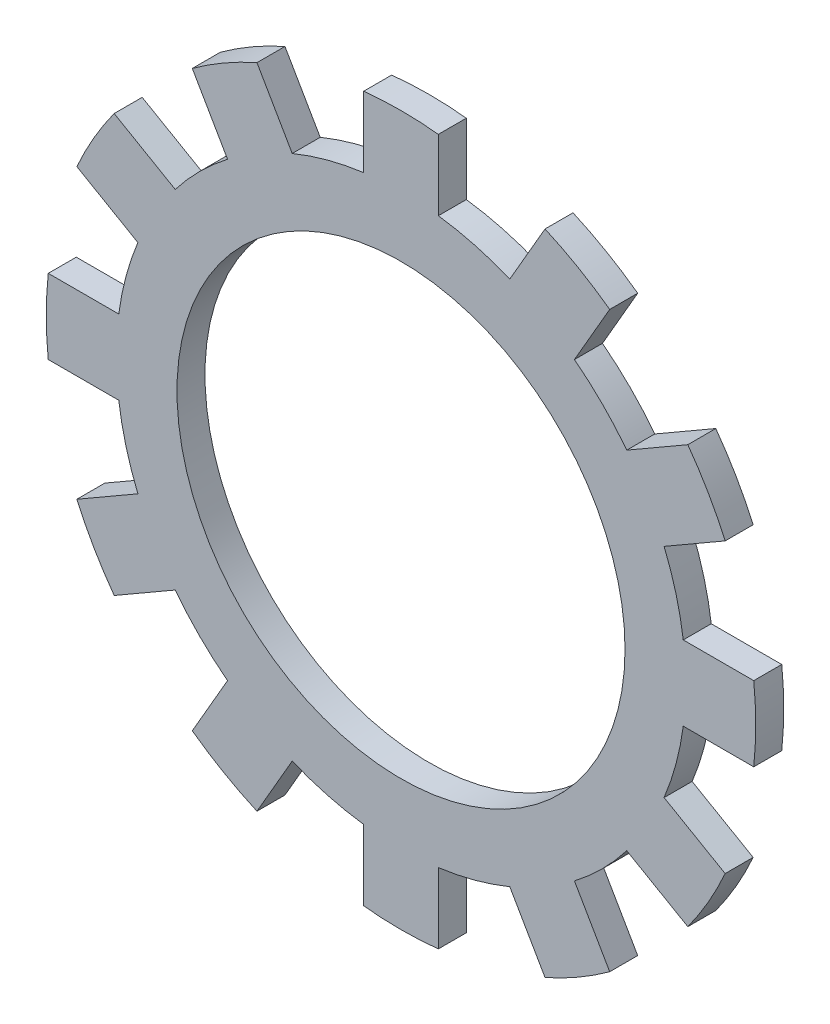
ISO-10303-21;
HEADER;
FILE_DESCRIPTION(('STEP AP214'),'2;1');
FILE_NAME('part.step','',(''),(''),'','','');
FILE_SCHEMA(('AUTOMOTIVE_DESIGN { 1 0 10303 214 1 1 1 1 }'));
ENDSEC;
DATA;
#1=APPLICATION_CONTEXT('core data for automotive mechanical design processes');
#2=APPLICATION_PROTOCOL_DEFINITION('international standard','automotive_design',2000,#1);
#3=PRODUCT_CONTEXT('',#1,'mechanical');
#4=PRODUCT('Part','Part','',(#3));
#5=PRODUCT_RELATED_PRODUCT_CATEGORY('part','',(#4));
#6=PRODUCT_DEFINITION_FORMATION('','',#4);
#7=PRODUCT_DEFINITION_CONTEXT('part definition',#1,'design');
#8=PRODUCT_DEFINITION('design','',#6,#7);
#9=PRODUCT_DEFINITION_SHAPE('','',#8);
#10=(LENGTH_UNIT() NAMED_UNIT(*) SI_UNIT(.MILLI.,.METRE.));
#11=(NAMED_UNIT(*) PLANE_ANGLE_UNIT() SI_UNIT($,.RADIAN.));
#12=(NAMED_UNIT(*) SI_UNIT($,.STERADIAN.) SOLID_ANGLE_UNIT());
#13=UNCERTAINTY_MEASURE_WITH_UNIT(LENGTH_MEASURE(1.E-05),#10,'distance_accuracy_value','');
#14=(GEOMETRIC_REPRESENTATION_CONTEXT(3) GLOBAL_UNCERTAINTY_ASSIGNED_CONTEXT((#13)) GLOBAL_UNIT_ASSIGNED_CONTEXT((#10,
#11,#12)) REPRESENTATION_CONTEXT('',''));
#15=CARTESIAN_POINT('',(0.,0.,0.));
#16=DIRECTION('',(0.,0.,1.));
#17=DIRECTION('',(1.,0.,0.));
#18=AXIS2_PLACEMENT_3D('',#15,#16,#17);
#19=CARTESIAN_POINT('',(0.,0.,0.75));
#20=DIRECTION('',(0.,0.,-1.));
#21=DIRECTION('',(-1.,0.,0.));
#22=AXIS2_PLACEMENT_3D('',#19,#20,#21);
#23=CYLINDRICAL_SURFACE('',#22,15.25);
#24=CARTESIAN_POINT('',(0.,0.,-0.75));
#25=DIRECTION('',(0.,0.,1.));
#26=DIRECTION('',(1.,0.,0.));
#27=AXIS2_PLACEMENT_3D('',#24,#25,#26);
#28=CIRCLE('',#27,15.25);
#29=CARTESIAN_POINT('',(12.092817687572,9.29119262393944,-0.75));
#30=VERTEX_POINT('',#29);
#31=CARTESIAN_POINT('',(9.29119262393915,12.0928176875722,-0.75));
#32=VERTEX_POINT('',#31);
#33=EDGE_CURVE('E361',#30,#32,#28,.T.);
#34=ORIENTED_EDGE('',*,*,#33,.T.);
#35=DIRECTION('',(0.,0.,-1.));
#36=VECTOR('',#35,1.);
#37=CARTESIAN_POINT('',(9.29119262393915,12.0928176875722,0.75));
#38=LINE('',#37,#36);
#39=CARTESIAN_POINT('',(9.29119262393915,12.0928176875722,0.75));
#40=VERTEX_POINT('',#39);
#41=EDGE_CURVE('E352',#40,#32,#38,.T.);
#42=ORIENTED_EDGE('',*,*,#41,.F.);
#43=CARTESIAN_POINT('',(0.,0.,0.75));
#44=DIRECTION('',(0.,0.,1.));
#45=DIRECTION('',(1.,0.,0.));
#46=AXIS2_PLACEMENT_3D('',#43,#44,#45);
#47=CIRCLE('',#46,15.25);
#48=CARTESIAN_POINT('',(12.092817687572,9.29119262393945,0.75));
#49=VERTEX_POINT('',#48);
#50=EDGE_CURVE('E64',#49,#40,#47,.T.);
#51=ORIENTED_EDGE('',*,*,#50,.F.);
#52=DIRECTION('',(0.,0.,-1.));
#53=VECTOR('',#52,1.);
#54=CARTESIAN_POINT('',(12.092817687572,9.29119262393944,0.75));
#55=LINE('',#54,#53);
#56=EDGE_CURVE('E626',#49,#30,#55,.T.);
#57=ORIENTED_EDGE('',*,*,#56,.T.);
#58=EDGE_LOOP('',(#34,#42,#51,#57));
#59=FACE_BOUND('',#58,.T.);
#60=ADVANCED_FACE('F39',(#59),#23,.T.);
#61=DIRECTION('',(0.,0.,-1.));
#62=VECTOR('',#61,1.);
#63=CARTESIAN_POINT('',(5.82709100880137,14.0928176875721,0.75));
#64=LINE('',#63,#62);
#65=CARTESIAN_POINT('',(5.82709100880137,14.0928176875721,0.75));
#66=VERTEX_POINT('',#65);
#67=CARTESIAN_POINT('',(5.82709100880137,14.0928176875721,-0.75));
#68=VERTEX_POINT('',#67);
#69=EDGE_CURVE('E645',#66,#68,#64,.T.);
#70=ORIENTED_EDGE('',*,*,#69,.T.);
#71=CARTESIAN_POINT('',(2.,15.1182836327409,-0.75));
#72=VERTEX_POINT('',#71);
#73=EDGE_CURVE('E388',#68,#72,#28,.T.);
#74=ORIENTED_EDGE('',*,*,#73,.T.);
#75=DIRECTION('',(0.,0.,-1.));
#76=VECTOR('',#75,1.);
#77=CARTESIAN_POINT('',(2.,15.1182836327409,0.75));
#78=LINE('',#77,#76);
#79=CARTESIAN_POINT('',(2.,15.1182836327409,0.75));
#80=VERTEX_POINT('',#79);
#81=EDGE_CURVE('E405',#80,#72,#78,.T.);
#82=ORIENTED_EDGE('',*,*,#81,.F.);
#83=EDGE_CURVE('E50',#66,#80,#47,.T.);
#84=ORIENTED_EDGE('',*,*,#83,.F.);
#85=EDGE_LOOP('',(#70,#74,#82,#84));
#86=FACE_BOUND('',#85,.T.);
#87=ADVANCED_FACE('F816',(#86),#23,.T.);
#88=CARTESIAN_POINT('',(15.1182836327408,2.00000000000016,-0.75));
#89=VERTEX_POINT('',#88);
#90=CARTESIAN_POINT('',(14.092817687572,5.82709100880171,-0.75));
#91=VERTEX_POINT('',#90);
#92=EDGE_CURVE('E907',#89,#91,#28,.T.);
#93=ORIENTED_EDGE('',*,*,#92,.T.);
#94=DIRECTION('',(0.,0.,-1.));
#95=VECTOR('',#94,1.);
#96=CARTESIAN_POINT('',(14.092817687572,5.82709100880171,0.75));
#97=LINE('',#96,#95);
#98=CARTESIAN_POINT('',(14.092817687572,5.82709100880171,0.75));
#99=VERTEX_POINT('',#98);
#100=EDGE_CURVE('E785',#99,#91,#97,.T.);
#101=ORIENTED_EDGE('',*,*,#100,.F.);
#102=CARTESIAN_POINT('',(15.1182836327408,2.00000000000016,0.75));
#103=VERTEX_POINT('',#102);
#104=EDGE_CURVE('E371',#103,#99,#47,.T.);
#105=ORIENTED_EDGE('',*,*,#104,.F.);
#106=DIRECTION('',(0.,0.,-1.));
#107=VECTOR('',#106,1.);
#108=CARTESIAN_POINT('',(15.1182836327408,2.00000000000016,0.75));
#109=LINE('',#108,#107);
#110=EDGE_CURVE('E604',#103,#89,#109,.T.);
#111=ORIENTED_EDGE('',*,*,#110,.T.);
#112=EDGE_LOOP('',(#93,#101,#105,#111));
#113=FACE_BOUND('',#112,.T.);
#114=ADVANCED_FACE('F905',(#113),#23,.T.);
#115=CARTESIAN_POINT('',(14.0928176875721,-5.82709100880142,-0.75));
#116=VERTEX_POINT('',#115);
#117=CARTESIAN_POINT('',(15.1182836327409,-1.99999999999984,-0.75));
#118=VERTEX_POINT('',#117);
#119=EDGE_CURVE('E888',#116,#118,#28,.T.);
#120=ORIENTED_EDGE('',*,*,#119,.T.);
#121=DIRECTION('',(0.,0.,-1.));
#122=VECTOR('',#121,1.);
#123=CARTESIAN_POINT('',(15.1182836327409,-1.99999999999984,0.75));
#124=LINE('',#123,#122);
#125=CARTESIAN_POINT('',(15.1182836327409,-1.99999999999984,0.75));
#126=VERTEX_POINT('',#125);
#127=EDGE_CURVE('E771',#126,#118,#124,.T.);
#128=ORIENTED_EDGE('',*,*,#127,.F.);
#129=CARTESIAN_POINT('',(14.0928176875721,-5.82709100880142,0.75));
#130=VERTEX_POINT('',#129);
#131=EDGE_CURVE('E376',#130,#126,#47,.T.);
#132=ORIENTED_EDGE('',*,*,#131,.F.);
#133=DIRECTION('',(0.,0.,-1.));
#134=VECTOR('',#133,1.);
#135=CARTESIAN_POINT('',(14.0928176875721,-5.82709100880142,0.75));
#136=LINE('',#135,#134);
#137=EDGE_CURVE('E583',#130,#116,#136,.T.);
#138=ORIENTED_EDGE('',*,*,#137,.T.);
#139=EDGE_LOOP('',(#120,#128,#132,#138));
#140=FACE_BOUND('',#139,.T.);
#141=ADVANCED_FACE('F887',(#140),#23,.T.);
#142=CARTESIAN_POINT('',(9.2911926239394,-12.092817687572,-0.75));
#143=VERTEX_POINT('',#142);
#144=CARTESIAN_POINT('',(12.0928176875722,-9.29119262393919,-0.75));
#145=VERTEX_POINT('',#144);
#146=EDGE_CURVE('E965',#143,#145,#28,.T.);
#147=ORIENTED_EDGE('',*,*,#146,.T.);
#148=DIRECTION('',(0.,0.,-1.));
#149=VECTOR('',#148,1.);
#150=CARTESIAN_POINT('',(12.0928176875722,-9.29119262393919,0.75));
#151=LINE('',#150,#149);
#152=CARTESIAN_POINT('',(12.0928176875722,-9.29119262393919,0.75));
#153=VERTEX_POINT('',#152);
#154=EDGE_CURVE('E757',#153,#145,#151,.T.);
#155=ORIENTED_EDGE('',*,*,#154,.F.);
#156=CARTESIAN_POINT('',(9.2911926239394,-12.092817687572,0.75));
#157=VERTEX_POINT('',#156);
#158=EDGE_CURVE('E874',#157,#153,#47,.T.);
#159=ORIENTED_EDGE('',*,*,#158,.F.);
#160=DIRECTION('',(0.,0.,-1.));
#161=VECTOR('',#160,1.);
#162=CARTESIAN_POINT('',(9.2911926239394,-12.092817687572,0.75));
#163=LINE('',#162,#161);
#164=EDGE_CURVE('E561',#157,#143,#163,.T.);
#165=ORIENTED_EDGE('',*,*,#164,.T.);
#166=EDGE_LOOP('',(#147,#155,#159,#165));
#167=FACE_BOUND('',#166,.T.);
#168=ADVANCED_FACE('F974',(#167),#23,.T.);
#169=CARTESIAN_POINT('',(2.,-15.1182836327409,-0.75));
#170=VERTEX_POINT('',#169);
#171=CARTESIAN_POINT('',(5.82709100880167,-14.092817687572,-0.75));
#172=VERTEX_POINT('',#171);
#173=EDGE_CURVE('E960',#170,#172,#28,.T.);
#174=ORIENTED_EDGE('',*,*,#173,.T.);
#175=DIRECTION('',(0.,0.,-1.));
#176=VECTOR('',#175,1.);
#177=CARTESIAN_POINT('',(5.82709100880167,-14.092817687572,0.75));
#178=LINE('',#177,#176);
#179=CARTESIAN_POINT('',(5.82709100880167,-14.092817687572,0.75));
#180=VERTEX_POINT('',#179);
#181=EDGE_CURVE('E743',#180,#172,#178,.T.);
#182=ORIENTED_EDGE('',*,*,#181,.F.);
#183=CARTESIAN_POINT('',(2.,-15.1182836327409,0.75));
#184=VERTEX_POINT('',#183);
#185=EDGE_CURVE('E869',#184,#180,#47,.T.);
#186=ORIENTED_EDGE('',*,*,#185,.F.);
#187=DIRECTION('',(0.,0.,-1.));
#188=VECTOR('',#187,1.);
#189=CARTESIAN_POINT('',(2.,-15.1182836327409,0.75));
#190=LINE('',#189,#188);
#191=EDGE_CURVE('E539',#184,#170,#190,.T.);
#192=ORIENTED_EDGE('',*,*,#191,.T.);
#193=EDGE_LOOP('',(#174,#182,#186,#192));
#194=FACE_BOUND('',#193,.T.);
#195=ADVANCED_FACE('F1402',(#194),#23,.T.);
#196=CARTESIAN_POINT('',(-5.82709100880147,-14.0928176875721,-0.75));
#197=VERTEX_POINT('',#196);
#198=CARTESIAN_POINT('',(-2.,-15.1182836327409,-0.75));
#199=VERTEX_POINT('',#198);
#200=EDGE_CURVE('E956',#197,#199,#28,.T.);
#201=ORIENTED_EDGE('',*,*,#200,.T.);
#202=DIRECTION('',(0.,0.,-1.));
#203=VECTOR('',#202,1.);
#204=CARTESIAN_POINT('',(-2.,-15.1182836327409,0.75));
#205=LINE('',#204,#203);
#206=CARTESIAN_POINT('',(-2.,-15.1182836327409,0.75));
#207=VERTEX_POINT('',#206);
#208=EDGE_CURVE('E729',#207,#199,#205,.T.);
#209=ORIENTED_EDGE('',*,*,#208,.F.);
#210=CARTESIAN_POINT('',(-5.82709100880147,-14.0928176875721,0.75));
#211=VERTEX_POINT('',#210);
#212=EDGE_CURVE('E864',#211,#207,#47,.T.);
#213=ORIENTED_EDGE('',*,*,#212,.F.);
#214=DIRECTION('',(0.,0.,-1.));
#215=VECTOR('',#214,1.);
#216=CARTESIAN_POINT('',(-5.82709100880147,-14.0928176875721,0.75));
#217=LINE('',#216,#215);
#218=EDGE_CURVE('E517',#211,#197,#217,.T.);
#219=ORIENTED_EDGE('',*,*,#218,.T.);
#220=EDGE_LOOP('',(#201,#209,#213,#219));
#221=FACE_BOUND('',#220,.T.);
#222=ADVANCED_FACE('F1394',(#221),#23,.T.);
#223=CARTESIAN_POINT('',(-12.092817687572,-9.29119262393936,-0.75));
#224=VERTEX_POINT('',#223);
#225=CARTESIAN_POINT('',(-9.29119262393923,-12.0928176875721,-0.75));
#226=VERTEX_POINT('',#225);
#227=EDGE_CURVE('E951',#224,#226,#28,.T.);
#228=ORIENTED_EDGE('',*,*,#227,.T.);
#229=DIRECTION('',(0.,0.,-1.));
#230=VECTOR('',#229,1.);
#231=CARTESIAN_POINT('',(-9.29119262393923,-12.0928176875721,0.75));
#232=LINE('',#231,#230);
#233=CARTESIAN_POINT('',(-9.29119262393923,-12.0928176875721,0.75));
#234=VERTEX_POINT('',#233);
#235=EDGE_CURVE('E715',#234,#226,#232,.T.);
#236=ORIENTED_EDGE('',*,*,#235,.F.);
#237=CARTESIAN_POINT('',(-12.092817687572,-9.29119262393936,0.75));
#238=VERTEX_POINT('',#237);
#239=EDGE_CURVE('E858',#238,#234,#47,.T.);
#240=ORIENTED_EDGE('',*,*,#239,.F.);
#241=DIRECTION('',(0.,0.,-1.));
#242=VECTOR('',#241,1.);
#243=CARTESIAN_POINT('',(-12.092817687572,-9.29119262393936,0.75));
#244=LINE('',#243,#242);
#245=EDGE_CURVE('E495',#238,#224,#244,.T.);
#246=ORIENTED_EDGE('',*,*,#245,.T.);
#247=EDGE_LOOP('',(#228,#236,#240,#246));
#248=FACE_BOUND('',#247,.T.);
#249=ADVANCED_FACE('F1386',(#248),#23,.T.);
#250=CARTESIAN_POINT('',(-15.1182836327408,-2.00000000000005,-0.75));
#251=VERTEX_POINT('',#250);
#252=CARTESIAN_POINT('',(-14.092817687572,-5.82709100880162,-0.75));
#253=VERTEX_POINT('',#252);
#254=EDGE_CURVE('E947',#251,#253,#28,.T.);
#255=ORIENTED_EDGE('',*,*,#254,.T.);
#256=DIRECTION('',(0.,0.,-1.));
#257=VECTOR('',#256,1.);
#258=CARTESIAN_POINT('',(-14.092817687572,-5.82709100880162,0.75));
#259=LINE('',#258,#257);
#260=CARTESIAN_POINT('',(-14.092817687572,-5.82709100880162,0.75));
#261=VERTEX_POINT('',#260);
#262=EDGE_CURVE('E701',#261,#253,#259,.T.);
#263=ORIENTED_EDGE('',*,*,#262,.F.);
#264=CARTESIAN_POINT('',(-15.1182836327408,-2.00000000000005,0.75));
#265=VERTEX_POINT('',#264);
#266=EDGE_CURVE('E854',#265,#261,#47,.T.);
#267=ORIENTED_EDGE('',*,*,#266,.F.);
#268=DIRECTION('',(0.,0.,-1.));
#269=VECTOR('',#268,1.);
#270=CARTESIAN_POINT('',(-15.1182836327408,-2.00000000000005,0.75));
#271=LINE('',#270,#269);
#272=EDGE_CURVE('E473',#265,#251,#271,.T.);
#273=ORIENTED_EDGE('',*,*,#272,.T.);
#274=EDGE_LOOP('',(#255,#263,#267,#273));
#275=FACE_BOUND('',#274,.T.);
#276=ADVANCED_FACE('F940',(#275),#23,.T.);
#277=CARTESIAN_POINT('',(-14.0928176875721,5.82709100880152,-0.75));
#278=VERTEX_POINT('',#277);
#279=CARTESIAN_POINT('',(-15.1182836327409,1.99999999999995,-0.75));
#280=VERTEX_POINT('',#279);
#281=EDGE_CURVE('E945',#278,#280,#28,.T.);
#282=ORIENTED_EDGE('',*,*,#281,.T.);
#283=DIRECTION('',(0.,0.,-1.));
#284=VECTOR('',#283,1.);
#285=CARTESIAN_POINT('',(-15.1182836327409,1.99999999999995,0.75));
#286=LINE('',#285,#284);
#287=CARTESIAN_POINT('',(-15.1182836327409,1.99999999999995,0.75));
#288=VERTEX_POINT('',#287);
#289=EDGE_CURVE('E687',#288,#280,#286,.T.);
#290=ORIENTED_EDGE('',*,*,#289,.F.);
#291=CARTESIAN_POINT('',(-14.0928176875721,5.82709100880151,0.75));
#292=VERTEX_POINT('',#291);
#293=EDGE_CURVE('E851',#292,#288,#47,.T.);
#294=ORIENTED_EDGE('',*,*,#293,.F.);
#295=DIRECTION('',(0.,0.,-1.));
#296=VECTOR('',#295,1.);
#297=CARTESIAN_POINT('',(-14.0928176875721,5.82709100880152,0.75));
#298=LINE('',#297,#296);
#299=EDGE_CURVE('E451',#292,#278,#298,.T.);
#300=ORIENTED_EDGE('',*,*,#299,.T.);
#301=EDGE_LOOP('',(#282,#290,#294,#300));
#302=FACE_BOUND('',#301,.T.);
#303=ADVANCED_FACE('F936',(#302),#23,.T.);
#304=CARTESIAN_POINT('',(-9.29119262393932,12.0928176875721,-0.75));
#305=VERTEX_POINT('',#304);
#306=CARTESIAN_POINT('',(-12.0928176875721,9.29119262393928,-0.75));
#307=VERTEX_POINT('',#306);
#308=EDGE_CURVE('E943',#305,#307,#28,.T.);
#309=ORIENTED_EDGE('',*,*,#308,.T.);
#310=DIRECTION('',(0.,0.,-1.));
#311=VECTOR('',#310,1.);
#312=CARTESIAN_POINT('',(-12.0928176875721,9.29119262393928,0.75));
#313=LINE('',#312,#311);
#314=CARTESIAN_POINT('',(-12.0928176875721,9.29119262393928,0.75));
#315=VERTEX_POINT('',#314);
#316=EDGE_CURVE('E673',#315,#307,#313,.T.);
#317=ORIENTED_EDGE('',*,*,#316,.F.);
#318=CARTESIAN_POINT('',(-9.29119262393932,12.0928176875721,0.75));
#319=VERTEX_POINT('',#318);
#320=EDGE_CURVE('E49',#319,#315,#47,.T.);
#321=ORIENTED_EDGE('',*,*,#320,.F.);
#322=DIRECTION('',(0.,0.,-1.));
#323=VECTOR('',#322,1.);
#324=CARTESIAN_POINT('',(-9.29119262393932,12.0928176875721,0.75));
#325=LINE('',#324,#323);
#326=EDGE_CURVE('E429',#319,#305,#325,.T.);
#327=ORIENTED_EDGE('',*,*,#326,.T.);
#328=EDGE_LOOP('',(#309,#317,#321,#327));
#329=FACE_BOUND('',#328,.T.);
#330=ADVANCED_FACE('F930',(#329),#23,.T.);
#331=CARTESIAN_POINT('',(-2.,15.1182836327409,-0.75));
#332=VERTEX_POINT('',#331);
#333=CARTESIAN_POINT('',(-5.82709100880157,14.0928176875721,-0.75));
#334=VERTEX_POINT('',#333);
#335=EDGE_CURVE('E43',#332,#334,#28,.T.);
#336=ORIENTED_EDGE('',*,*,#335,.T.);
#337=DIRECTION('',(0.,0.,-1.));
#338=VECTOR('',#337,1.);
#339=CARTESIAN_POINT('',(-5.82709100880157,14.0928176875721,0.75));
#340=LINE('',#339,#338);
#341=CARTESIAN_POINT('',(-5.82709100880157,14.0928176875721,0.75));
#342=VERTEX_POINT('',#341);
#343=EDGE_CURVE('E657',#342,#334,#340,.T.);
#344=ORIENTED_EDGE('',*,*,#343,.F.);
#345=CARTESIAN_POINT('',(-2.,15.1182836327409,0.75));
#346=VERTEX_POINT('',#345);
#347=EDGE_CURVE('E11',#346,#342,#47,.T.);
#348=ORIENTED_EDGE('',*,*,#347,.F.);
#349=DIRECTION('',(0.,0.,-1.));
#350=VECTOR('',#349,1.);
#351=CARTESIAN_POINT('',(-2.,15.1182836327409,0.75));
#352=LINE('',#351,#350);
#353=EDGE_CURVE('E392',#346,#332,#352,.T.);
#354=ORIENTED_EDGE('',*,*,#353,.T.);
#355=EDGE_LOOP('',(#336,#344,#348,#354));
#356=FACE_BOUND('',#355,.T.);
#357=ADVANCED_FACE('F41',(#356),#23,.T.);
#358=CARTESIAN_POINT('',(0.,0.,0.75));
#359=DIRECTION('',(0.,0.,1.));
#360=DIRECTION('',(1.,0.,0.));
#361=AXIS2_PLACEMENT_3D('',#358,#359,#360);
#362=PLANE('',#361);
#363=ORIENTED_EDGE('',*,*,#347,.T.);
#364=DIRECTION('',(0.500000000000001,-0.866025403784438,0.));
#365=VECTOR('',#364,1.);
#366=CARTESIAN_POINT('',(-7.71517100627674,17.3630681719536,0.75));
#367=LINE('',#366,#365);
#368=CARTESIAN_POINT('',(-7.71517100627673,17.3630681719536,0.75));
#369=VERTEX_POINT('',#368);
#370=EDGE_CURVE('E668',#369,#342,#367,.T.);
#371=ORIENTED_EDGE('',*,*,#370,.F.);
#372=CARTESIAN_POINT('',(0.,0.,0.75));
#373=DIRECTION('',(0.,0.,1.));
#374=DIRECTION('',(0.866025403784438,0.500000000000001,0.));
#375=AXIS2_PLACEMENT_3D('',#372,#373,#374);
#376=CIRCLE('',#375,19.);
#377=CARTESIAN_POINT('',(-11.1792726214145,15.3630681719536,0.75));
#378=VERTEX_POINT('',#377);
#379=EDGE_CURVE('E438',#369,#378,#376,.T.);
#380=ORIENTED_EDGE('',*,*,#379,.T.);
#381=DIRECTION('',(0.500000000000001,-0.866025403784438,0.));
#382=VECTOR('',#381,1.);
#383=CARTESIAN_POINT('',(-11.1792726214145,15.3630681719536,0.75));
#384=LINE('',#383,#382);
#385=EDGE_CURVE('E433',#378,#319,#384,.T.);
#386=ORIENTED_EDGE('',*,*,#385,.T.);
#387=ORIENTED_EDGE('',*,*,#320,.T.);
#388=DIRECTION('',(0.86602540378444,-0.499999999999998,0.));
#389=VECTOR('',#388,1.);
#390=CARTESIAN_POINT('',(-15.3630681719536,11.1792726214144,0.75));
#391=LINE('',#390,#389);
#392=CARTESIAN_POINT('',(-15.3630681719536,11.1792726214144,0.75));
#393=VERTEX_POINT('',#392);
#394=EDGE_CURVE('E682',#393,#315,#391,.T.);
#395=ORIENTED_EDGE('',*,*,#394,.F.);
#396=CARTESIAN_POINT('',(0.,0.,0.75));
#397=DIRECTION('',(0.,0.,1.));
#398=DIRECTION('',(0.499999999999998,0.86602540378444,0.));
#399=AXIS2_PLACEMENT_3D('',#396,#397,#398);
#400=CIRCLE('',#399,19.);
#401=CARTESIAN_POINT('',(-17.3630681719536,7.71517100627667,0.75));
#402=VERTEX_POINT('',#401);
#403=EDGE_CURVE('E460',#393,#402,#400,.T.);
#404=ORIENTED_EDGE('',*,*,#403,.T.);
#405=DIRECTION('',(0.86602540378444,-0.499999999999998,0.));
#406=VECTOR('',#405,1.);
#407=CARTESIAN_POINT('',(-17.3630681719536,7.71517100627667,0.75));
#408=LINE('',#407,#406);
#409=EDGE_CURVE('E455',#402,#292,#408,.T.);
#410=ORIENTED_EDGE('',*,*,#409,.T.);
#411=ORIENTED_EDGE('',*,*,#293,.T.);
#412=DIRECTION('',(1.,0.,0.));
#413=VECTOR('',#412,1.);
#414=CARTESIAN_POINT('',(-18.8944436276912,1.99999999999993,0.75));
#415=LINE('',#414,#413);
#416=CARTESIAN_POINT('',(-18.8944436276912,1.99999999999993,0.75));
#417=VERTEX_POINT('',#416);
#418=EDGE_CURVE('E696',#417,#288,#415,.T.);
#419=ORIENTED_EDGE('',*,*,#418,.F.);
#420=CARTESIAN_POINT('',(0.,0.,0.75));
#421=DIRECTION('',(0.,0.,1.));
#422=DIRECTION('',(0.,1.,0.));
#423=AXIS2_PLACEMENT_3D('',#420,#421,#422);
#424=CIRCLE('',#423,19.);
#425=CARTESIAN_POINT('',(-18.8944436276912,-2.00000000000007,0.75));
#426=VERTEX_POINT('',#425);
#427=EDGE_CURVE('E482',#417,#426,#424,.T.);
#428=ORIENTED_EDGE('',*,*,#427,.T.);
#429=DIRECTION('',(1.,0.,0.));
#430=VECTOR('',#429,1.);
#431=CARTESIAN_POINT('',(-18.8944436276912,-2.00000000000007,0.75));
#432=LINE('',#431,#430);
#433=EDGE_CURVE('E477',#426,#265,#432,.T.);
#434=ORIENTED_EDGE('',*,*,#433,.T.);
#435=ORIENTED_EDGE('',*,*,#266,.T.);
#436=DIRECTION('',(0.866025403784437,0.500000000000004,0.));
#437=VECTOR('',#436,1.);
#438=CARTESIAN_POINT('',(-17.3630681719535,-7.7151710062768,0.75));
#439=LINE('',#438,#437);
#440=CARTESIAN_POINT('',(-17.3630681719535,-7.7151710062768,0.75));
#441=VERTEX_POINT('',#440);
#442=EDGE_CURVE('E710',#441,#261,#439,.T.);
#443=ORIENTED_EDGE('',*,*,#442,.F.);
#444=CARTESIAN_POINT('',(0.,0.,0.75));
#445=DIRECTION('',(0.,0.,1.));
#446=DIRECTION('',(-0.500000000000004,0.866025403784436,0.));
#447=AXIS2_PLACEMENT_3D('',#444,#445,#446);
#448=CIRCLE('',#447,19.);
#449=CARTESIAN_POINT('',(-15.3630681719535,-11.1792726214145,0.75));
#450=VERTEX_POINT('',#449);
#451=EDGE_CURVE('E504',#441,#450,#448,.T.);
#452=ORIENTED_EDGE('',*,*,#451,.T.);
#453=DIRECTION('',(0.866025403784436,0.500000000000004,0.));
#454=VECTOR('',#453,1.);
#455=CARTESIAN_POINT('',(-15.3630681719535,-11.1792726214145,0.75));
#456=LINE('',#455,#454);
#457=EDGE_CURVE('E499',#450,#238,#456,.T.);
#458=ORIENTED_EDGE('',*,*,#457,.T.);
#459=ORIENTED_EDGE('',*,*,#239,.T.);
#460=DIRECTION('',(0.499999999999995,0.866025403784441,0.));
#461=VECTOR('',#460,1.);
#462=CARTESIAN_POINT('',(-11.1792726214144,-15.3630681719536,0.75));
#463=LINE('',#462,#461);
#464=CARTESIAN_POINT('',(-11.1792726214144,-15.3630681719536,0.75));
#465=VERTEX_POINT('',#464);
#466=EDGE_CURVE('E724',#465,#234,#463,.T.);
#467=ORIENTED_EDGE('',*,*,#466,.F.);
#468=CARTESIAN_POINT('',(0.,0.,0.75));
#469=DIRECTION('',(0.,0.,1.));
#470=DIRECTION('',(-0.866025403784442,0.499999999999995,0.));
#471=AXIS2_PLACEMENT_3D('',#468,#469,#470);
#472=CIRCLE('',#471,19.);
#473=CARTESIAN_POINT('',(-7.71517100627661,-17.3630681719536,0.75));
#474=VERTEX_POINT('',#473);
#475=EDGE_CURVE('E526',#465,#474,#472,.T.);
#476=ORIENTED_EDGE('',*,*,#475,.T.);
#477=DIRECTION('',(0.499999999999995,0.866025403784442,0.));
#478=VECTOR('',#477,1.);
#479=CARTESIAN_POINT('',(-7.71517100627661,-17.3630681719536,0.75));
#480=LINE('',#479,#478);
#481=EDGE_CURVE('E521',#474,#211,#480,.T.);
#482=ORIENTED_EDGE('',*,*,#481,.T.);
#483=ORIENTED_EDGE('',*,*,#212,.T.);
#484=DIRECTION('',(0.,1.,0.));
#485=VECTOR('',#484,1.);
#486=CARTESIAN_POINT('',(-2.,-18.8944436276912,0.75));
#487=LINE('',#486,#485);
#488=CARTESIAN_POINT('',(-2.,-18.8944436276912,0.75));
#489=VERTEX_POINT('',#488);
#490=EDGE_CURVE('E738',#489,#207,#487,.T.);
#491=ORIENTED_EDGE('',*,*,#490,.F.);
#492=CARTESIAN_POINT('',(0.,0.,0.75));
#493=DIRECTION('',(0.,0.,1.));
#494=DIRECTION('',(-1.,0.,0.));
#495=AXIS2_PLACEMENT_3D('',#492,#493,#494);
#496=CIRCLE('',#495,19.);
#497=CARTESIAN_POINT('',(2.,-18.8944436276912,0.75));
#498=VERTEX_POINT('',#497);
#499=EDGE_CURVE('E548',#489,#498,#496,.T.);
#500=ORIENTED_EDGE('',*,*,#499,.T.);
#501=DIRECTION('',(0.,1.,0.));
#502=VECTOR('',#501,1.);
#503=CARTESIAN_POINT('',(2.,-18.8944436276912,0.75));
#504=LINE('',#503,#502);
#505=EDGE_CURVE('E543',#498,#184,#504,.T.);
#506=ORIENTED_EDGE('',*,*,#505,.T.);
#507=ORIENTED_EDGE('',*,*,#185,.T.);
#508=DIRECTION('',(-0.500000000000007,0.866025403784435,0.));
#509=VECTOR('',#508,1.);
#510=CARTESIAN_POINT('',(7.71517100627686,-17.3630681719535,0.75));
#511=LINE('',#510,#509);
#512=CARTESIAN_POINT('',(7.71517100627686,-17.3630681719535,0.75));
#513=VERTEX_POINT('',#512);
#514=EDGE_CURVE('E752',#513,#180,#511,.T.);
#515=ORIENTED_EDGE('',*,*,#514,.F.);
#516=CARTESIAN_POINT('',(0.,0.,0.75));
#517=DIRECTION('',(0.,0.,1.));
#518=DIRECTION('',(-0.866025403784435,-0.500000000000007,0.));
#519=AXIS2_PLACEMENT_3D('',#516,#517,#518);
#520=CIRCLE('',#519,19.);
#521=CARTESIAN_POINT('',(11.1792726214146,-15.3630681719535,0.75));
#522=VERTEX_POINT('',#521);
#523=EDGE_CURVE('E570',#513,#522,#520,.T.);
#524=ORIENTED_EDGE('',*,*,#523,.T.);
#525=DIRECTION('',(-0.500000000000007,0.866025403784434,0.));
#526=VECTOR('',#525,1.);
#527=CARTESIAN_POINT('',(11.1792726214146,-15.3630681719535,0.75));
#528=LINE('',#527,#526);
#529=EDGE_CURVE('E565',#522,#157,#528,.T.);
#530=ORIENTED_EDGE('',*,*,#529,.T.);
#531=ORIENTED_EDGE('',*,*,#158,.T.);
#532=DIRECTION('',(-0.866025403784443,0.499999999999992,0.));
#533=VECTOR('',#532,1.);
#534=CARTESIAN_POINT('',(15.3630681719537,-11.1792726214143,0.75));
#535=LINE('',#534,#533);
#536=CARTESIAN_POINT('',(15.3630681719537,-11.1792726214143,0.75));
#537=VERTEX_POINT('',#536);
#538=EDGE_CURVE('E766',#537,#153,#535,.T.);
#539=ORIENTED_EDGE('',*,*,#538,.F.);
#540=CARTESIAN_POINT('',(0.,0.,0.75));
#541=DIRECTION('',(0.,0.,1.));
#542=DIRECTION('',(-0.499999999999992,-0.866025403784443,0.));
#543=AXIS2_PLACEMENT_3D('',#540,#541,#542);
#544=CIRCLE('',#543,19.);
#545=CARTESIAN_POINT('',(17.3630681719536,-7.71517100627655,0.75));
#546=VERTEX_POINT('',#545);
#547=EDGE_CURVE('E592',#537,#546,#544,.T.);
#548=ORIENTED_EDGE('',*,*,#547,.T.);
#549=DIRECTION('',(-0.866025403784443,0.499999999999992,0.));
#550=VECTOR('',#549,1.);
#551=CARTESIAN_POINT('',(17.3630681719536,-7.71517100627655,0.75));
#552=LINE('',#551,#550);
#553=EDGE_CURVE('E587',#546,#130,#552,.T.);
#554=ORIENTED_EDGE('',*,*,#553,.T.);
#555=ORIENTED_EDGE('',*,*,#131,.T.);
#556=DIRECTION('',(-1.,0.,0.));
#557=VECTOR('',#556,1.);
#558=CARTESIAN_POINT('',(18.8944436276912,-1.9999999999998,0.75));
#559=LINE('',#558,#557);
#560=CARTESIAN_POINT('',(18.8944436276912,-1.9999999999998,0.75));
#561=VERTEX_POINT('',#560);
#562=EDGE_CURVE('E780',#561,#126,#559,.T.);
#563=ORIENTED_EDGE('',*,*,#562,.F.);
#564=CARTESIAN_POINT('',(0.,0.,0.75));
#565=DIRECTION('',(0.,0.,1.));
#566=DIRECTION('',(0.,-1.,0.));
#567=AXIS2_PLACEMENT_3D('',#564,#565,#566);
#568=CIRCLE('',#567,19.);
#569=CARTESIAN_POINT('',(18.8944436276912,2.0000000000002,0.75));
#570=VERTEX_POINT('',#569);
#571=EDGE_CURVE('E613',#561,#570,#568,.T.);
#572=ORIENTED_EDGE('',*,*,#571,.T.);
#573=DIRECTION('',(-1.,0.,0.));
#574=VECTOR('',#573,1.);
#575=CARTESIAN_POINT('',(18.8944436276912,2.0000000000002,0.75));
#576=LINE('',#575,#574);
#577=EDGE_CURVE('E608',#570,#103,#576,.T.);
#578=ORIENTED_EDGE('',*,*,#577,.T.);
#579=ORIENTED_EDGE('',*,*,#104,.T.);
#580=DIRECTION('',(-0.866025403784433,-0.50000000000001,0.));
#581=VECTOR('',#580,1.);
#582=CARTESIAN_POINT('',(17.3630681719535,7.71517100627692,0.75));
#583=LINE('',#582,#581);
#584=CARTESIAN_POINT('',(17.3630681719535,7.71517100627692,0.75));
#585=VERTEX_POINT('',#584);
#586=EDGE_CURVE('E794',#585,#99,#583,.T.);
#587=ORIENTED_EDGE('',*,*,#586,.F.);
#588=CARTESIAN_POINT('',(0.,0.,0.75));
#589=DIRECTION('',(0.,0.,1.));
#590=DIRECTION('',(0.50000000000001,-0.866025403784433,0.));
#591=AXIS2_PLACEMENT_3D('',#588,#589,#590);
#592=CIRCLE('',#591,19.);
#593=CARTESIAN_POINT('',(15.3630681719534,11.1792726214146,0.75));
#594=VERTEX_POINT('',#593);
#595=EDGE_CURVE('E633',#585,#594,#592,.T.);
#596=ORIENTED_EDGE('',*,*,#595,.T.);
#597=DIRECTION('',(-0.866025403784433,-0.50000000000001,0.));
#598=VECTOR('',#597,1.);
#599=CARTESIAN_POINT('',(15.3630681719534,11.1792726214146,0.75));
#600=LINE('',#599,#598);
#601=EDGE_CURVE('E368',#594,#49,#600,.T.);
#602=ORIENTED_EDGE('',*,*,#601,.T.);
#603=ORIENTED_EDGE('',*,*,#50,.T.);
#604=DIRECTION('',(-0.499999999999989,-0.866025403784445,0.));
#605=VECTOR('',#604,1.);
#606=CARTESIAN_POINT('',(11.1792726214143,15.3630681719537,0.75));
#607=LINE('',#606,#605);
#608=CARTESIAN_POINT('',(11.1792726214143,15.3630681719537,0.75));
#609=VERTEX_POINT('',#608);
#610=EDGE_CURVE('E349',#609,#40,#607,.T.);
#611=ORIENTED_EDGE('',*,*,#610,.F.);
#612=CARTESIAN_POINT('',(0.,0.,0.75));
#613=DIRECTION('',(0.,0.,1.));
#614=DIRECTION('',(0.866025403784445,-0.499999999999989,0.));
#615=AXIS2_PLACEMENT_3D('',#612,#613,#614);
#616=CIRCLE('',#615,19.);
#617=CARTESIAN_POINT('',(7.71517100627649,17.3630681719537,0.75));
#618=VERTEX_POINT('',#617);
#619=EDGE_CURVE('E653',#609,#618,#616,.T.);
#620=ORIENTED_EDGE('',*,*,#619,.T.);
#621=DIRECTION('',(-0.499999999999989,-0.866025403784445,0.));
#622=VECTOR('',#621,1.);
#623=CARTESIAN_POINT('',(7.71517100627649,17.3630681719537,0.75));
#624=LINE('',#623,#622);
#625=EDGE_CURVE('E648',#618,#66,#624,.T.);
#626=ORIENTED_EDGE('',*,*,#625,.T.);
#627=ORIENTED_EDGE('',*,*,#83,.T.);
#628=DIRECTION('',(0.,-1.,0.));
#629=VECTOR('',#628,1.);
#630=CARTESIAN_POINT('',(2.,18.8944436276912,0.75));
#631=LINE('',#630,#629);
#632=CARTESIAN_POINT('',(2.,18.8944436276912,0.75));
#633=VERTEX_POINT('',#632);
#634=EDGE_CURVE('E417',#633,#80,#631,.T.);
#635=ORIENTED_EDGE('',*,*,#634,.F.);
#636=CARTESIAN_POINT('',(0.,0.,0.75));
#637=DIRECTION('',(0.,0.,1.));
#638=DIRECTION('',(1.,0.,0.));
#639=AXIS2_PLACEMENT_3D('',#636,#637,#638);
#640=CIRCLE('',#639,19.);
#641=CARTESIAN_POINT('',(-2.,18.8944436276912,0.75));
#642=VERTEX_POINT('',#641);
#643=EDGE_CURVE('E401',#633,#642,#640,.T.);
#644=ORIENTED_EDGE('',*,*,#643,.T.);
#645=DIRECTION('',(0.,-1.,0.));
#646=VECTOR('',#645,1.);
#647=CARTESIAN_POINT('',(-2.,18.8944436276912,0.75));
#648=LINE('',#647,#646);
#649=EDGE_CURVE('E396',#642,#346,#648,.T.);
#650=ORIENTED_EDGE('',*,*,#649,.T.);
#651=EDGE_LOOP('',(#363,#371,#380,#386,#387,#395,#404,#410,#411,#419,#428,#434,#435,#443,#452,
#458,#459,#467,#476,#482,#483,#491,#500,#506,#507,#515,#524,#530,#531,#539,#548,#554,#555,#563,
#572,#578,#579,#587,#596,#602,#603,#611,#620,#626,#627,#635,#644,#650));
#652=FACE_BOUND('',#651,.T.);
#653=CARTESIAN_POINT('',(0.,0.,0.75));
#654=DIRECTION('',(0.,0.,1.));
#655=DIRECTION('',(1.,0.,0.));
#656=AXIS2_PLACEMENT_3D('',#653,#654,#655);
#657=CIRCLE('',#656,12.);
#658=CARTESIAN_POINT('',(12.,0.,0.75));
#659=VERTEX_POINT('',#658);
#660=EDGE_CURVE('E383',#659,#659,#657,.T.);
#661=ORIENTED_EDGE('',*,*,#660,.F.);
#662=EDGE_LOOP('',(#661));
#663=FACE_BOUND('',#662,.T.);
#664=ADVANCED_FACE('F365',(#652,#663),#362,.T.);
#665=CARTESIAN_POINT('',(0.,0.,-0.75));
#666=DIRECTION('',(0.,0.,1.));
#667=DIRECTION('',(1.,0.,0.));
#668=AXIS2_PLACEMENT_3D('',#665,#666,#667);
#669=PLANE('',#668);
#670=ORIENTED_EDGE('',*,*,#335,.F.);
#671=DIRECTION('',(0.,-1.,0.));
#672=VECTOR('',#671,1.);
#673=CARTESIAN_POINT('',(-2.,18.8944436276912,-0.75));
#674=LINE('',#673,#672);
#675=CARTESIAN_POINT('',(-2.,18.8944436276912,-0.75));
#676=VERTEX_POINT('',#675);
#677=EDGE_CURVE('E397',#676,#332,#674,.T.);
#678=ORIENTED_EDGE('',*,*,#677,.F.);
#679=CARTESIAN_POINT('',(0.,0.,-0.75));
#680=DIRECTION('',(0.,0.,1.));
#681=DIRECTION('',(1.,0.,0.));
#682=AXIS2_PLACEMENT_3D('',#679,#680,#681);
#683=CIRCLE('',#682,19.);
#684=CARTESIAN_POINT('',(2.,18.8944436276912,-0.75));
#685=VERTEX_POINT('',#684);
#686=EDGE_CURVE('E402',#685,#676,#683,.T.);
#687=ORIENTED_EDGE('',*,*,#686,.F.);
#688=DIRECTION('',(0.,-1.,0.));
#689=VECTOR('',#688,1.);
#690=CARTESIAN_POINT('',(2.,18.8944436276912,-0.75));
#691=LINE('',#690,#689);
#692=EDGE_CURVE('E418',#685,#72,#691,.T.);
#693=ORIENTED_EDGE('',*,*,#692,.T.);
#694=ORIENTED_EDGE('',*,*,#73,.F.);
#695=DIRECTION('',(-0.499999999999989,-0.866025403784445,0.));
#696=VECTOR('',#695,1.);
#697=CARTESIAN_POINT('',(7.71517100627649,17.3630681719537,-0.75));
#698=LINE('',#697,#696);
#699=CARTESIAN_POINT('',(7.71517100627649,17.3630681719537,-0.75));
#700=VERTEX_POINT('',#699);
#701=EDGE_CURVE('E649',#700,#68,#698,.T.);
#702=ORIENTED_EDGE('',*,*,#701,.F.);
#703=CARTESIAN_POINT('',(0.,0.,-0.75));
#704=DIRECTION('',(0.,0.,1.));
#705=DIRECTION('',(0.866025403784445,-0.499999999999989,0.));
#706=AXIS2_PLACEMENT_3D('',#703,#704,#705);
#707=CIRCLE('',#706,19.);
#708=CARTESIAN_POINT('',(11.1792726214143,15.3630681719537,-0.75));
#709=VERTEX_POINT('',#708);
#710=EDGE_CURVE('E654',#709,#700,#707,.T.);
#711=ORIENTED_EDGE('',*,*,#710,.F.);
#712=DIRECTION('',(-0.499999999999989,-0.866025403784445,0.));
#713=VECTOR('',#712,1.);
#714=CARTESIAN_POINT('',(11.1792726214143,15.3630681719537,-0.75));
#715=LINE('',#714,#713);
#716=EDGE_CURVE('E358',#709,#32,#715,.T.);
#717=ORIENTED_EDGE('',*,*,#716,.T.);
#718=ORIENTED_EDGE('',*,*,#33,.F.);
#719=DIRECTION('',(-0.866025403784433,-0.50000000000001,0.));
#720=VECTOR('',#719,1.);
#721=CARTESIAN_POINT('',(15.3630681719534,11.1792726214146,-0.75));
#722=LINE('',#721,#720);
#723=CARTESIAN_POINT('',(15.3630681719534,11.1792726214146,-0.75));
#724=VERTEX_POINT('',#723);
#725=EDGE_CURVE('E629',#724,#30,#722,.T.);
#726=ORIENTED_EDGE('',*,*,#725,.F.);
#727=CARTESIAN_POINT('',(0.,0.,-0.75));
#728=DIRECTION('',(0.,0.,1.));
#729=DIRECTION('',(0.50000000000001,-0.866025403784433,0.));
#730=AXIS2_PLACEMENT_3D('',#727,#728,#729);
#731=CIRCLE('',#730,19.);
#732=CARTESIAN_POINT('',(17.3630681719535,7.71517100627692,-0.75));
#733=VERTEX_POINT('',#732);
#734=EDGE_CURVE('E634',#733,#724,#731,.T.);
#735=ORIENTED_EDGE('',*,*,#734,.F.);
#736=DIRECTION('',(-0.866025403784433,-0.50000000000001,0.));
#737=VECTOR('',#736,1.);
#738=CARTESIAN_POINT('',(17.3630681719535,7.71517100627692,-0.75));
#739=LINE('',#738,#737);
#740=EDGE_CURVE('E363',#733,#91,#739,.T.);
#741=ORIENTED_EDGE('',*,*,#740,.T.);
#742=ORIENTED_EDGE('',*,*,#92,.F.);
#743=DIRECTION('',(-1.,0.,0.));
#744=VECTOR('',#743,1.);
#745=CARTESIAN_POINT('',(18.8944436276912,2.0000000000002,-0.75));
#746=LINE('',#745,#744);
#747=CARTESIAN_POINT('',(18.8944436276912,2.0000000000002,-0.75));
#748=VERTEX_POINT('',#747);
#749=EDGE_CURVE('E609',#748,#89,#746,.T.);
#750=ORIENTED_EDGE('',*,*,#749,.F.);
#751=CARTESIAN_POINT('',(0.,0.,-0.75));
#752=DIRECTION('',(0.,0.,1.));
#753=DIRECTION('',(0.,-1.,0.));
#754=AXIS2_PLACEMENT_3D('',#751,#752,#753);
#755=CIRCLE('',#754,19.);
#756=CARTESIAN_POINT('',(18.8944436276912,-1.9999999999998,-0.75));
#757=VERTEX_POINT('',#756);
#758=EDGE_CURVE('E614',#757,#748,#755,.T.);
#759=ORIENTED_EDGE('',*,*,#758,.F.);
#760=DIRECTION('',(-1.,0.,0.));
#761=VECTOR('',#760,1.);
#762=CARTESIAN_POINT('',(18.8944436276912,-1.9999999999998,-0.75));
#763=LINE('',#762,#761);
#764=EDGE_CURVE('E781',#757,#118,#763,.T.);
#765=ORIENTED_EDGE('',*,*,#764,.T.);
#766=ORIENTED_EDGE('',*,*,#119,.F.);
#767=DIRECTION('',(-0.866025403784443,0.499999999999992,0.));
#768=VECTOR('',#767,1.);
#769=CARTESIAN_POINT('',(17.3630681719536,-7.71517100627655,-0.75));
#770=LINE('',#769,#768);
#771=CARTESIAN_POINT('',(17.3630681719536,-7.71517100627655,-0.75));
#772=VERTEX_POINT('',#771);
#773=EDGE_CURVE('E588',#772,#116,#770,.T.);
#774=ORIENTED_EDGE('',*,*,#773,.F.);
#775=CARTESIAN_POINT('',(0.,0.,-0.75));
#776=DIRECTION('',(0.,0.,1.));
#777=DIRECTION('',(-0.499999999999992,-0.866025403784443,0.));
#778=AXIS2_PLACEMENT_3D('',#775,#776,#777);
#779=CIRCLE('',#778,19.);
#780=CARTESIAN_POINT('',(15.3630681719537,-11.1792726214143,-0.75));
#781=VERTEX_POINT('',#780);
#782=EDGE_CURVE('E593',#781,#772,#779,.T.);
#783=ORIENTED_EDGE('',*,*,#782,.F.);
#784=DIRECTION('',(-0.866025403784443,0.499999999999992,0.));
#785=VECTOR('',#784,1.);
#786=CARTESIAN_POINT('',(15.3630681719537,-11.1792726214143,-0.75));
#787=LINE('',#786,#785);
#788=EDGE_CURVE('E767',#781,#145,#787,.T.);
#789=ORIENTED_EDGE('',*,*,#788,.T.);
#790=ORIENTED_EDGE('',*,*,#146,.F.);
#791=DIRECTION('',(-0.500000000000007,0.866025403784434,0.));
#792=VECTOR('',#791,1.);
#793=CARTESIAN_POINT('',(11.1792726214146,-15.3630681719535,-0.75));
#794=LINE('',#793,#792);
#795=CARTESIAN_POINT('',(11.1792726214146,-15.3630681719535,-0.75));
#796=VERTEX_POINT('',#795);
#797=EDGE_CURVE('E566',#796,#143,#794,.T.);
#798=ORIENTED_EDGE('',*,*,#797,.F.);
#799=CARTESIAN_POINT('',(0.,0.,-0.75));
#800=DIRECTION('',(0.,0.,1.));
#801=DIRECTION('',(-0.866025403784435,-0.500000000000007,0.));
#802=AXIS2_PLACEMENT_3D('',#799,#800,#801);
#803=CIRCLE('',#802,19.);
#804=CARTESIAN_POINT('',(7.71517100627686,-17.3630681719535,-0.75));
#805=VERTEX_POINT('',#804);
#806=EDGE_CURVE('E571',#805,#796,#803,.T.);
#807=ORIENTED_EDGE('',*,*,#806,.F.);
#808=DIRECTION('',(-0.500000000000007,0.866025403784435,0.));
#809=VECTOR('',#808,1.);
#810=CARTESIAN_POINT('',(7.71517100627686,-17.3630681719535,-0.75));
#811=LINE('',#810,#809);
#812=EDGE_CURVE('E753',#805,#172,#811,.T.);
#813=ORIENTED_EDGE('',*,*,#812,.T.);
#814=ORIENTED_EDGE('',*,*,#173,.F.);
#815=DIRECTION('',(0.,1.,0.));
#816=VECTOR('',#815,1.);
#817=CARTESIAN_POINT('',(2.,-18.8944436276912,-0.75));
#818=LINE('',#817,#816);
#819=CARTESIAN_POINT('',(2.,-18.8944436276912,-0.75));
#820=VERTEX_POINT('',#819);
#821=EDGE_CURVE('E544',#820,#170,#818,.T.);
#822=ORIENTED_EDGE('',*,*,#821,.F.);
#823=CARTESIAN_POINT('',(0.,0.,-0.75));
#824=DIRECTION('',(0.,0.,1.));
#825=DIRECTION('',(-1.,0.,0.));
#826=AXIS2_PLACEMENT_3D('',#823,#824,#825);
#827=CIRCLE('',#826,19.);
#828=CARTESIAN_POINT('',(-2.,-18.8944436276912,-0.75));
#829=VERTEX_POINT('',#828);
#830=EDGE_CURVE('E549',#829,#820,#827,.T.);
#831=ORIENTED_EDGE('',*,*,#830,.F.);
#832=DIRECTION('',(0.,1.,0.));
#833=VECTOR('',#832,1.);
#834=CARTESIAN_POINT('',(-2.,-18.8944436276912,-0.75));
#835=LINE('',#834,#833);
#836=EDGE_CURVE('E739',#829,#199,#835,.T.);
#837=ORIENTED_EDGE('',*,*,#836,.T.);
#838=ORIENTED_EDGE('',*,*,#200,.F.);
#839=DIRECTION('',(0.499999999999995,0.866025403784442,0.));
#840=VECTOR('',#839,1.);
#841=CARTESIAN_POINT('',(-7.71517100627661,-17.3630681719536,-0.75));
#842=LINE('',#841,#840);
#843=CARTESIAN_POINT('',(-7.71517100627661,-17.3630681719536,-0.75));
#844=VERTEX_POINT('',#843);
#845=EDGE_CURVE('E522',#844,#197,#842,.T.);
#846=ORIENTED_EDGE('',*,*,#845,.F.);
#847=CARTESIAN_POINT('',(0.,0.,-0.75));
#848=DIRECTION('',(0.,0.,1.));
#849=DIRECTION('',(-0.866025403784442,0.499999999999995,0.));
#850=AXIS2_PLACEMENT_3D('',#847,#848,#849);
#851=CIRCLE('',#850,19.);
#852=CARTESIAN_POINT('',(-11.1792726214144,-15.3630681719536,-0.75));
#853=VERTEX_POINT('',#852);
#854=EDGE_CURVE('E527',#853,#844,#851,.T.);
#855=ORIENTED_EDGE('',*,*,#854,.F.);
#856=DIRECTION('',(0.499999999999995,0.866025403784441,0.));
#857=VECTOR('',#856,1.);
#858=CARTESIAN_POINT('',(-11.1792726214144,-15.3630681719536,-0.75));
#859=LINE('',#858,#857);
#860=EDGE_CURVE('E725',#853,#226,#859,.T.);
#861=ORIENTED_EDGE('',*,*,#860,.T.);
#862=ORIENTED_EDGE('',*,*,#227,.F.);
#863=DIRECTION('',(0.866025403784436,0.500000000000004,0.));
#864=VECTOR('',#863,1.);
#865=CARTESIAN_POINT('',(-15.3630681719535,-11.1792726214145,-0.75));
#866=LINE('',#865,#864);
#867=CARTESIAN_POINT('',(-15.3630681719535,-11.1792726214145,-0.75));
#868=VERTEX_POINT('',#867);
#869=EDGE_CURVE('E500',#868,#224,#866,.T.);
#870=ORIENTED_EDGE('',*,*,#869,.F.);
#871=CARTESIAN_POINT('',(0.,0.,-0.75));
#872=DIRECTION('',(0.,0.,1.));
#873=DIRECTION('',(-0.500000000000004,0.866025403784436,0.));
#874=AXIS2_PLACEMENT_3D('',#871,#872,#873);
#875=CIRCLE('',#874,19.);
#876=CARTESIAN_POINT('',(-17.3630681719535,-7.7151710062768,-0.75));
#877=VERTEX_POINT('',#876);
#878=EDGE_CURVE('E505',#877,#868,#875,.T.);
#879=ORIENTED_EDGE('',*,*,#878,.F.);
#880=DIRECTION('',(0.866025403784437,0.500000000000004,0.));
#881=VECTOR('',#880,1.);
#882=CARTESIAN_POINT('',(-17.3630681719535,-7.7151710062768,-0.75));
#883=LINE('',#882,#881);
#884=EDGE_CURVE('E711',#877,#253,#883,.T.);
#885=ORIENTED_EDGE('',*,*,#884,.T.);
#886=ORIENTED_EDGE('',*,*,#254,.F.);
#887=DIRECTION('',(1.,0.,0.));
#888=VECTOR('',#887,1.);
#889=CARTESIAN_POINT('',(-18.8944436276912,-2.00000000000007,-0.75));
#890=LINE('',#889,#888);
#891=CARTESIAN_POINT('',(-18.8944436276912,-2.00000000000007,-0.75));
#892=VERTEX_POINT('',#891);
#893=EDGE_CURVE('E478',#892,#251,#890,.T.);
#894=ORIENTED_EDGE('',*,*,#893,.F.);
#895=CARTESIAN_POINT('',(0.,0.,-0.75));
#896=DIRECTION('',(0.,0.,1.));
#897=DIRECTION('',(0.,1.,0.));
#898=AXIS2_PLACEMENT_3D('',#895,#896,#897);
#899=CIRCLE('',#898,19.);
#900=CARTESIAN_POINT('',(-18.8944436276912,1.99999999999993,-0.75));
#901=VERTEX_POINT('',#900);
#902=EDGE_CURVE('E483',#901,#892,#899,.T.);
#903=ORIENTED_EDGE('',*,*,#902,.F.);
#904=DIRECTION('',(1.,0.,0.));
#905=VECTOR('',#904,1.);
#906=CARTESIAN_POINT('',(-18.8944436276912,1.99999999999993,-0.75));
#907=LINE('',#906,#905);
#908=EDGE_CURVE('E697',#901,#280,#907,.T.);
#909=ORIENTED_EDGE('',*,*,#908,.T.);
#910=ORIENTED_EDGE('',*,*,#281,.F.);
#911=DIRECTION('',(0.86602540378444,-0.499999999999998,0.));
#912=VECTOR('',#911,1.);
#913=CARTESIAN_POINT('',(-17.3630681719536,7.71517100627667,-0.75));
#914=LINE('',#913,#912);
#915=CARTESIAN_POINT('',(-17.3630681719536,7.71517100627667,-0.75));
#916=VERTEX_POINT('',#915);
#917=EDGE_CURVE('E456',#916,#278,#914,.T.);
#918=ORIENTED_EDGE('',*,*,#917,.F.);
#919=CARTESIAN_POINT('',(0.,0.,-0.75));
#920=DIRECTION('',(0.,0.,1.));
#921=DIRECTION('',(0.499999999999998,0.86602540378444,0.));
#922=AXIS2_PLACEMENT_3D('',#919,#920,#921);
#923=CIRCLE('',#922,19.);
#924=CARTESIAN_POINT('',(-15.3630681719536,11.1792726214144,-0.75));
#925=VERTEX_POINT('',#924);
#926=EDGE_CURVE('E461',#925,#916,#923,.T.);
#927=ORIENTED_EDGE('',*,*,#926,.F.);
#928=DIRECTION('',(0.86602540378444,-0.499999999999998,0.));
#929=VECTOR('',#928,1.);
#930=CARTESIAN_POINT('',(-15.3630681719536,11.1792726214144,-0.75));
#931=LINE('',#930,#929);
#932=EDGE_CURVE('E683',#925,#307,#931,.T.);
#933=ORIENTED_EDGE('',*,*,#932,.T.);
#934=ORIENTED_EDGE('',*,*,#308,.F.);
#935=DIRECTION('',(0.500000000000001,-0.866025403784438,0.));
#936=VECTOR('',#935,1.);
#937=CARTESIAN_POINT('',(-11.1792726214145,15.3630681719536,-0.75));
#938=LINE('',#937,#936);
#939=CARTESIAN_POINT('',(-11.1792726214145,15.3630681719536,-0.75));
#940=VERTEX_POINT('',#939);
#941=EDGE_CURVE('E434',#940,#305,#938,.T.);
#942=ORIENTED_EDGE('',*,*,#941,.F.);
#943=CARTESIAN_POINT('',(0.,0.,-0.75));
#944=DIRECTION('',(0.,0.,1.));
#945=DIRECTION('',(0.866025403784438,0.500000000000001,0.));
#946=AXIS2_PLACEMENT_3D('',#943,#944,#945);
#947=CIRCLE('',#946,19.);
#948=CARTESIAN_POINT('',(-7.71517100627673,17.3630681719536,-0.75));
#949=VERTEX_POINT('',#948);
#950=EDGE_CURVE('E439',#949,#940,#947,.T.);
#951=ORIENTED_EDGE('',*,*,#950,.F.);
#952=DIRECTION('',(0.500000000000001,-0.866025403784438,0.));
#953=VECTOR('',#952,1.);
#954=CARTESIAN_POINT('',(-7.71517100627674,17.3630681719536,-0.75));
#955=LINE('',#954,#953);
#956=EDGE_CURVE('E669',#949,#334,#955,.T.);
#957=ORIENTED_EDGE('',*,*,#956,.T.);
#958=EDGE_LOOP('',(#670,#678,#687,#693,#694,#702,#711,#717,#718,#726,#735,#741,#742,#750,#759,
#765,#766,#774,#783,#789,#790,#798,#807,#813,#814,#822,#831,#837,#838,#846,#855,#861,#862,#870,
#879,#885,#886,#894,#903,#909,#910,#918,#927,#933,#934,#942,#951,#957));
#959=FACE_BOUND('',#958,.T.);
#960=CARTESIAN_POINT('',(0.,0.,-0.75));
#961=DIRECTION('',(0.,0.,1.));
#962=DIRECTION('',(1.,0.,0.));
#963=AXIS2_PLACEMENT_3D('',#960,#961,#962);
#964=CIRCLE('',#963,12.);
#965=CARTESIAN_POINT('',(12.,0.,-0.75));
#966=VERTEX_POINT('',#965);
#967=EDGE_CURVE('E379',#966,#966,#964,.T.);
#968=ORIENTED_EDGE('',*,*,#967,.T.);
#969=EDGE_LOOP('',(#968));
#970=FACE_BOUND('',#969,.T.);
#971=ADVANCED_FACE('F804',(#959,#970),#669,.F.);
#972=CARTESIAN_POINT('',(0.,0.,0.75));
#973=DIRECTION('',(0.,0.,-1.));
#974=DIRECTION('',(-1.,0.,0.));
#975=AXIS2_PLACEMENT_3D('',#972,#973,#974);
#976=CYLINDRICAL_SURFACE('',#975,12.);
#977=ORIENTED_EDGE('',*,*,#660,.T.);
#978=EDGE_LOOP('',(#977));
#979=FACE_BOUND('',#978,.T.);
#980=ORIENTED_EDGE('',*,*,#967,.F.);
#981=EDGE_LOOP('',(#980));
#982=FACE_BOUND('',#981,.T.);
#983=ADVANCED_FACE('F1054',(#979,#982),#976,.F.);
#984=CARTESIAN_POINT('',(0.,0.,0.75));
#985=DIRECTION('',(0.,0.,-1.));
#986=DIRECTION('',(-1.,0.,0.));
#987=AXIS2_PLACEMENT_3D('',#984,#985,#986);
#988=CYLINDRICAL_SURFACE('',#987,19.);
#989=ORIENTED_EDGE('',*,*,#686,.T.);
#990=DIRECTION('',(0.,0.,-1.));
#991=VECTOR('',#990,1.);
#992=CARTESIAN_POINT('',(-2.,18.8944436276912,0.75));
#993=LINE('',#992,#991);
#994=EDGE_CURVE('E384',#642,#676,#993,.T.);
#995=ORIENTED_EDGE('',*,*,#994,.F.);
#996=ORIENTED_EDGE('',*,*,#643,.F.);
#997=DIRECTION('',(0.,0.,-1.));
#998=VECTOR('',#997,1.);
#999=CARTESIAN_POINT('',(2.,18.8944436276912,0.75));
#1000=LINE('',#999,#998);
#1001=EDGE_CURVE('E413',#633,#685,#1000,.T.);
#1002=ORIENTED_EDGE('',*,*,#1001,.T.);
#1003=EDGE_LOOP('',(#989,#995,#996,#1002));
#1004=FACE_BOUND('',#1003,.T.);
#1005=ADVANCED_FACE('F825',(#1004),#988,.T.);
#1006=CARTESIAN_POINT('',(-2.,18.8944436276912,0.75));
#1007=DIRECTION('',(1.,0.,0.));
#1008=DIRECTION('',(0.,1.,0.));
#1009=AXIS2_PLACEMENT_3D('',#1006,#1007,#1008);
#1010=PLANE('',#1009);
#1011=ORIENTED_EDGE('',*,*,#677,.T.);
#1012=ORIENTED_EDGE('',*,*,#353,.F.);
#1013=ORIENTED_EDGE('',*,*,#649,.F.);
#1014=ORIENTED_EDGE('',*,*,#994,.T.);
#1015=EDGE_LOOP('',(#1011,#1012,#1013,#1014));
#1016=FACE_BOUND('',#1015,.T.);
#1017=ADVANCED_FACE('F829',(#1016),#1010,.F.);
#1018=CARTESIAN_POINT('',(2.,18.8944436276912,0.75));
#1019=DIRECTION('',(1.,0.,0.));
#1020=DIRECTION('',(0.,1.,0.));
#1021=AXIS2_PLACEMENT_3D('',#1018,#1019,#1020);
#1022=PLANE('',#1021);
#1023=ORIENTED_EDGE('',*,*,#692,.F.);
#1024=ORIENTED_EDGE('',*,*,#1001,.F.);
#1025=ORIENTED_EDGE('',*,*,#634,.T.);
#1026=ORIENTED_EDGE('',*,*,#81,.T.);
#1027=EDGE_LOOP('',(#1023,#1024,#1025,#1026));
#1028=FACE_BOUND('',#1027,.T.);
#1029=ADVANCED_FACE('F820',(#1028),#1022,.T.);
#1030=CARTESIAN_POINT('',(0.,0.,0.75));
#1031=DIRECTION('',(0.,0.,-1.));
#1032=DIRECTION('',(-1.,0.,0.));
#1033=AXIS2_PLACEMENT_3D('',#1030,#1031,#1032);
#1034=CYLINDRICAL_SURFACE('',#1033,19.);
#1035=ORIENTED_EDGE('',*,*,#950,.T.);
#1036=DIRECTION('',(0.,0.,-1.));
#1037=VECTOR('',#1036,1.);
#1038=CARTESIAN_POINT('',(-11.1792726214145,15.3630681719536,0.75));
#1039=LINE('',#1038,#1037);
#1040=EDGE_CURVE('E422',#378,#940,#1039,.T.);
#1041=ORIENTED_EDGE('',*,*,#1040,.F.);
#1042=ORIENTED_EDGE('',*,*,#379,.F.);
#1043=DIRECTION('',(0.,0.,-1.));
#1044=VECTOR('',#1043,1.);
#1045=CARTESIAN_POINT('',(-7.71517100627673,17.3630681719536,0.75));
#1046=LINE('',#1045,#1044);
#1047=EDGE_CURVE('E664',#369,#949,#1046,.T.);
#1048=ORIENTED_EDGE('',*,*,#1047,.T.);
#1049=EDGE_LOOP('',(#1035,#1041,#1042,#1048));
#1050=FACE_BOUND('',#1049,.T.);
#1051=ADVANCED_FACE('F840',(#1050),#1034,.T.);
#1052=CARTESIAN_POINT('',(-11.1792726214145,15.3630681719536,0.75));
#1053=DIRECTION('',(0.866025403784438,0.500000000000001,0.));
#1054=DIRECTION('',(-0.500000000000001,0.866025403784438,0.));
#1055=AXIS2_PLACEMENT_3D('',#1052,#1053,#1054);
#1056=PLANE('',#1055);
#1057=ORIENTED_EDGE('',*,*,#941,.T.);
#1058=ORIENTED_EDGE('',*,*,#326,.F.);
#1059=ORIENTED_EDGE('',*,*,#385,.F.);
#1060=ORIENTED_EDGE('',*,*,#1040,.T.);
#1061=EDGE_LOOP('',(#1057,#1058,#1059,#1060));
#1062=FACE_BOUND('',#1061,.T.);
#1063=ADVANCED_FACE('F845',(#1062),#1056,.F.);
#1064=CARTESIAN_POINT('',(0.,0.,0.75));
#1065=DIRECTION('',(0.,0.,-1.));
#1066=DIRECTION('',(-1.,0.,0.));
#1067=AXIS2_PLACEMENT_3D('',#1064,#1065,#1066);
#1068=CYLINDRICAL_SURFACE('',#1067,19.);
#1069=ORIENTED_EDGE('',*,*,#926,.T.);
#1070=DIRECTION('',(0.,0.,-1.));
#1071=VECTOR('',#1070,1.);
#1072=CARTESIAN_POINT('',(-17.3630681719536,7.71517100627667,0.75));
#1073=LINE('',#1072,#1071);
#1074=EDGE_CURVE('E442',#402,#916,#1073,.T.);
#1075=ORIENTED_EDGE('',*,*,#1074,.F.);
#1076=ORIENTED_EDGE('',*,*,#403,.F.);
#1077=DIRECTION('',(0.,0.,-1.));
#1078=VECTOR('',#1077,1.);
#1079=CARTESIAN_POINT('',(-15.3630681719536,11.1792726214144,0.75));
#1080=LINE('',#1079,#1078);
#1081=EDGE_CURVE('E678',#393,#925,#1080,.T.);
#1082=ORIENTED_EDGE('',*,*,#1081,.T.);
#1083=EDGE_LOOP('',(#1069,#1075,#1076,#1082));
#1084=FACE_BOUND('',#1083,.T.);
#1085=ADVANCED_FACE('F1039',(#1084),#1068,.T.);
#1086=CARTESIAN_POINT('',(-17.3630681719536,7.71517100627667,0.75));
#1087=DIRECTION('',(0.499999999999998,0.86602540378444,0.));
#1088=DIRECTION('',(-0.86602540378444,0.499999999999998,0.));
#1089=AXIS2_PLACEMENT_3D('',#1086,#1087,#1088);
#1090=PLANE('',#1089);
#1091=ORIENTED_EDGE('',*,*,#917,.T.);
#1092=ORIENTED_EDGE('',*,*,#299,.F.);
#1093=ORIENTED_EDGE('',*,*,#409,.F.);
#1094=ORIENTED_EDGE('',*,*,#1074,.T.);
#1095=EDGE_LOOP('',(#1091,#1092,#1093,#1094));
#1096=FACE_BOUND('',#1095,.T.);
#1097=ADVANCED_FACE('F1035',(#1096),#1090,.F.);
#1098=CARTESIAN_POINT('',(0.,0.,0.75));
#1099=DIRECTION('',(0.,0.,-1.));
#1100=DIRECTION('',(-1.,0.,0.));
#1101=AXIS2_PLACEMENT_3D('',#1098,#1099,#1100);
#1102=CYLINDRICAL_SURFACE('',#1101,19.);
#1103=ORIENTED_EDGE('',*,*,#902,.T.);
#1104=DIRECTION('',(0.,0.,-1.));
#1105=VECTOR('',#1104,1.);
#1106=CARTESIAN_POINT('',(-18.8944436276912,-2.00000000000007,0.75));
#1107=LINE('',#1106,#1105);
#1108=EDGE_CURVE('E464',#426,#892,#1107,.T.);
#1109=ORIENTED_EDGE('',*,*,#1108,.F.);
#1110=ORIENTED_EDGE('',*,*,#427,.F.);
#1111=DIRECTION('',(0.,0.,-1.));
#1112=VECTOR('',#1111,1.);
#1113=CARTESIAN_POINT('',(-18.8944436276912,1.99999999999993,0.75));
#1114=LINE('',#1113,#1112);
#1115=EDGE_CURVE('E692',#417,#901,#1114,.T.);
#1116=ORIENTED_EDGE('',*,*,#1115,.T.);
#1117=EDGE_LOOP('',(#1103,#1109,#1110,#1116));
#1118=FACE_BOUND('',#1117,.T.);
#1119=ADVANCED_FACE('F1031',(#1118),#1102,.T.);
#1120=CARTESIAN_POINT('',(-18.8944436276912,-2.00000000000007,0.75));
#1121=DIRECTION('',(0.,1.,0.));
#1122=DIRECTION('',(-1.,0.,0.));
#1123=AXIS2_PLACEMENT_3D('',#1120,#1121,#1122);
#1124=PLANE('',#1123);
#1125=ORIENTED_EDGE('',*,*,#893,.T.);
#1126=ORIENTED_EDGE('',*,*,#272,.F.);
#1127=ORIENTED_EDGE('',*,*,#433,.F.);
#1128=ORIENTED_EDGE('',*,*,#1108,.T.);
#1129=EDGE_LOOP('',(#1125,#1126,#1127,#1128));
#1130=FACE_BOUND('',#1129,.T.);
#1131=ADVANCED_FACE('F1027',(#1130),#1124,.F.);
#1132=CARTESIAN_POINT('',(0.,0.,0.75));
#1133=DIRECTION('',(0.,0.,-1.));
#1134=DIRECTION('',(-1.,0.,0.));
#1135=AXIS2_PLACEMENT_3D('',#1132,#1133,#1134);
#1136=CYLINDRICAL_SURFACE('',#1135,19.);
#1137=ORIENTED_EDGE('',*,*,#878,.T.);
#1138=DIRECTION('',(0.,0.,-1.));
#1139=VECTOR('',#1138,1.);
#1140=CARTESIAN_POINT('',(-15.3630681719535,-11.1792726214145,0.75));
#1141=LINE('',#1140,#1139);
#1142=EDGE_CURVE('E486',#450,#868,#1141,.T.);
#1143=ORIENTED_EDGE('',*,*,#1142,.F.);
#1144=ORIENTED_EDGE('',*,*,#451,.F.);
#1145=DIRECTION('',(0.,0.,-1.));
#1146=VECTOR('',#1145,1.);
#1147=CARTESIAN_POINT('',(-17.3630681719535,-7.7151710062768,0.75));
#1148=LINE('',#1147,#1146);
#1149=EDGE_CURVE('E706',#441,#877,#1148,.T.);
#1150=ORIENTED_EDGE('',*,*,#1149,.T.);
#1151=EDGE_LOOP('',(#1137,#1143,#1144,#1150));
#1152=FACE_BOUND('',#1151,.T.);
#1153=ADVANCED_FACE('F1023',(#1152),#1136,.T.);
#1154=CARTESIAN_POINT('',(-15.3630681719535,-11.1792726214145,0.75));
#1155=DIRECTION('',(-0.500000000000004,0.866025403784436,0.));
#1156=DIRECTION('',(-0.866025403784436,-0.500000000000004,0.));
#1157=AXIS2_PLACEMENT_3D('',#1154,#1155,#1156);
#1158=PLANE('',#1157);
#1159=ORIENTED_EDGE('',*,*,#869,.T.);
#1160=ORIENTED_EDGE('',*,*,#245,.F.);
#1161=ORIENTED_EDGE('',*,*,#457,.F.);
#1162=ORIENTED_EDGE('',*,*,#1142,.T.);
#1163=EDGE_LOOP('',(#1159,#1160,#1161,#1162));
#1164=FACE_BOUND('',#1163,.T.);
#1165=ADVANCED_FACE('F1019',(#1164),#1158,.F.);
#1166=CARTESIAN_POINT('',(0.,0.,0.75));
#1167=DIRECTION('',(0.,0.,-1.));
#1168=DIRECTION('',(-1.,0.,0.));
#1169=AXIS2_PLACEMENT_3D('',#1166,#1167,#1168);
#1170=CYLINDRICAL_SURFACE('',#1169,19.);
#1171=ORIENTED_EDGE('',*,*,#854,.T.);
#1172=DIRECTION('',(0.,0.,-1.));
#1173=VECTOR('',#1172,1.);
#1174=CARTESIAN_POINT('',(-7.71517100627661,-17.3630681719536,0.75));
#1175=LINE('',#1174,#1173);
#1176=EDGE_CURVE('E508',#474,#844,#1175,.T.);
#1177=ORIENTED_EDGE('',*,*,#1176,.F.);
#1178=ORIENTED_EDGE('',*,*,#475,.F.);
#1179=DIRECTION('',(0.,0.,-1.));
#1180=VECTOR('',#1179,1.);
#1181=CARTESIAN_POINT('',(-11.1792726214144,-15.3630681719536,0.75));
#1182=LINE('',#1181,#1180);
#1183=EDGE_CURVE('E720',#465,#853,#1182,.T.);
#1184=ORIENTED_EDGE('',*,*,#1183,.T.);
#1185=EDGE_LOOP('',(#1171,#1177,#1178,#1184));
#1186=FACE_BOUND('',#1185,.T.);
#1187=ADVANCED_FACE('F1015',(#1186),#1170,.T.);
#1188=CARTESIAN_POINT('',(-7.71517100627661,-17.3630681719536,0.75));
#1189=DIRECTION('',(-0.866025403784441,0.499999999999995,0.));
#1190=DIRECTION('',(-0.499999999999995,-0.866025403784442,0.));
#1191=AXIS2_PLACEMENT_3D('',#1188,#1189,#1190);
#1192=PLANE('',#1191);
#1193=ORIENTED_EDGE('',*,*,#845,.T.);
#1194=ORIENTED_EDGE('',*,*,#218,.F.);
#1195=ORIENTED_EDGE('',*,*,#481,.F.);
#1196=ORIENTED_EDGE('',*,*,#1176,.T.);
#1197=EDGE_LOOP('',(#1193,#1194,#1195,#1196));
#1198=FACE_BOUND('',#1197,.T.);
#1199=ADVANCED_FACE('F1011',(#1198),#1192,.F.);
#1200=CARTESIAN_POINT('',(0.,0.,0.75));
#1201=DIRECTION('',(0.,0.,-1.));
#1202=DIRECTION('',(-1.,0.,0.));
#1203=AXIS2_PLACEMENT_3D('',#1200,#1201,#1202);
#1204=CYLINDRICAL_SURFACE('',#1203,19.);
#1205=ORIENTED_EDGE('',*,*,#830,.T.);
#1206=DIRECTION('',(0.,0.,-1.));
#1207=VECTOR('',#1206,1.);
#1208=CARTESIAN_POINT('',(2.,-18.8944436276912,0.75));
#1209=LINE('',#1208,#1207);
#1210=EDGE_CURVE('E530',#498,#820,#1209,.T.);
#1211=ORIENTED_EDGE('',*,*,#1210,.F.);
#1212=ORIENTED_EDGE('',*,*,#499,.F.);
#1213=DIRECTION('',(0.,0.,-1.));
#1214=VECTOR('',#1213,1.);
#1215=CARTESIAN_POINT('',(-2.,-18.8944436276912,0.75));
#1216=LINE('',#1215,#1214);
#1217=EDGE_CURVE('E734',#489,#829,#1216,.T.);
#1218=ORIENTED_EDGE('',*,*,#1217,.T.);
#1219=EDGE_LOOP('',(#1205,#1211,#1212,#1218));
#1220=FACE_BOUND('',#1219,.T.);
#1221=ADVANCED_FACE('F1007',(#1220),#1204,.T.);
#1222=CARTESIAN_POINT('',(2.,-18.8944436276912,0.75));
#1223=DIRECTION('',(-1.,0.,0.));
#1224=DIRECTION('',(0.,-1.,0.));
#1225=AXIS2_PLACEMENT_3D('',#1222,#1223,#1224);
#1226=PLANE('',#1225);
#1227=ORIENTED_EDGE('',*,*,#821,.T.);
#1228=ORIENTED_EDGE('',*,*,#191,.F.);
#1229=ORIENTED_EDGE('',*,*,#505,.F.);
#1230=ORIENTED_EDGE('',*,*,#1210,.T.);
#1231=EDGE_LOOP('',(#1227,#1228,#1229,#1230));
#1232=FACE_BOUND('',#1231,.T.);
#1233=ADVANCED_FACE('F1003',(#1232),#1226,.F.);
#1234=CARTESIAN_POINT('',(0.,0.,0.75));
#1235=DIRECTION('',(0.,0.,-1.));
#1236=DIRECTION('',(-1.,0.,0.));
#1237=AXIS2_PLACEMENT_3D('',#1234,#1235,#1236);
#1238=CYLINDRICAL_SURFACE('',#1237,19.);
#1239=ORIENTED_EDGE('',*,*,#806,.T.);
#1240=DIRECTION('',(0.,0.,-1.));
#1241=VECTOR('',#1240,1.);
#1242=CARTESIAN_POINT('',(11.1792726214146,-15.3630681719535,0.75));
#1243=LINE('',#1242,#1241);
#1244=EDGE_CURVE('E552',#522,#796,#1243,.T.);
#1245=ORIENTED_EDGE('',*,*,#1244,.F.);
#1246=ORIENTED_EDGE('',*,*,#523,.F.);
#1247=DIRECTION('',(0.,0.,-1.));
#1248=VECTOR('',#1247,1.);
#1249=CARTESIAN_POINT('',(7.71517100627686,-17.3630681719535,0.75));
#1250=LINE('',#1249,#1248);
#1251=EDGE_CURVE('E748',#513,#805,#1250,.T.);
#1252=ORIENTED_EDGE('',*,*,#1251,.T.);
#1253=EDGE_LOOP('',(#1239,#1245,#1246,#1252));
#1254=FACE_BOUND('',#1253,.T.);
#1255=ADVANCED_FACE('F999',(#1254),#1238,.T.);
#1256=CARTESIAN_POINT('',(11.1792726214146,-15.3630681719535,0.75));
#1257=DIRECTION('',(-0.866025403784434,-0.500000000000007,0.));
#1258=DIRECTION('',(0.500000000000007,-0.866025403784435,0.));
#1259=AXIS2_PLACEMENT_3D('',#1256,#1257,#1258);
#1260=PLANE('',#1259);
#1261=ORIENTED_EDGE('',*,*,#797,.T.);
#1262=ORIENTED_EDGE('',*,*,#164,.F.);
#1263=ORIENTED_EDGE('',*,*,#529,.F.);
#1264=ORIENTED_EDGE('',*,*,#1244,.T.);
#1265=EDGE_LOOP('',(#1261,#1262,#1263,#1264));
#1266=FACE_BOUND('',#1265,.T.);
#1267=ADVANCED_FACE('F993',(#1266),#1260,.F.);
#1268=CARTESIAN_POINT('',(0.,0.,0.75));
#1269=DIRECTION('',(0.,0.,-1.));
#1270=DIRECTION('',(-1.,0.,0.));
#1271=AXIS2_PLACEMENT_3D('',#1268,#1269,#1270);
#1272=CYLINDRICAL_SURFACE('',#1271,19.);
#1273=ORIENTED_EDGE('',*,*,#782,.T.);
#1274=DIRECTION('',(0.,0.,-1.));
#1275=VECTOR('',#1274,1.);
#1276=CARTESIAN_POINT('',(17.3630681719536,-7.71517100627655,0.75));
#1277=LINE('',#1276,#1275);
#1278=EDGE_CURVE('E574',#546,#772,#1277,.T.);
#1279=ORIENTED_EDGE('',*,*,#1278,.F.);
#1280=ORIENTED_EDGE('',*,*,#547,.F.);
#1281=DIRECTION('',(0.,0.,-1.));
#1282=VECTOR('',#1281,1.);
#1283=CARTESIAN_POINT('',(15.3630681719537,-11.1792726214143,0.75));
#1284=LINE('',#1283,#1282);
#1285=EDGE_CURVE('E762',#537,#781,#1284,.T.);
#1286=ORIENTED_EDGE('',*,*,#1285,.T.);
#1287=EDGE_LOOP('',(#1273,#1279,#1280,#1286));
#1288=FACE_BOUND('',#1287,.T.);
#1289=ADVANCED_FACE('F983',(#1288),#1272,.T.);
#1290=CARTESIAN_POINT('',(17.3630681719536,-7.71517100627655,0.75));
#1291=DIRECTION('',(-0.499999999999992,-0.866025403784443,0.));
#1292=DIRECTION('',(0.866025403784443,-0.499999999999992,0.));
#1293=AXIS2_PLACEMENT_3D('',#1290,#1291,#1292);
#1294=PLANE('',#1293);
#1295=ORIENTED_EDGE('',*,*,#773,.T.);
#1296=ORIENTED_EDGE('',*,*,#137,.F.);
#1297=ORIENTED_EDGE('',*,*,#553,.F.);
#1298=ORIENTED_EDGE('',*,*,#1278,.T.);
#1299=EDGE_LOOP('',(#1295,#1296,#1297,#1298));
#1300=FACE_BOUND('',#1299,.T.);
#1301=ADVANCED_FACE('F985',(#1300),#1294,.F.);
#1302=CARTESIAN_POINT('',(0.,0.,0.75));
#1303=DIRECTION('',(0.,0.,-1.));
#1304=DIRECTION('',(-1.,0.,0.));
#1305=AXIS2_PLACEMENT_3D('',#1302,#1303,#1304);
#1306=CYLINDRICAL_SURFACE('',#1305,19.);
#1307=ORIENTED_EDGE('',*,*,#758,.T.);
#1308=DIRECTION('',(0.,0.,-1.));
#1309=VECTOR('',#1308,1.);
#1310=CARTESIAN_POINT('',(18.8944436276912,2.0000000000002,0.75));
#1311=LINE('',#1310,#1309);
#1312=EDGE_CURVE('E596',#570,#748,#1311,.T.);
#1313=ORIENTED_EDGE('',*,*,#1312,.F.);
#1314=ORIENTED_EDGE('',*,*,#571,.F.);
#1315=DIRECTION('',(0.,0.,-1.));
#1316=VECTOR('',#1315,1.);
#1317=CARTESIAN_POINT('',(18.8944436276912,-1.9999999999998,0.75));
#1318=LINE('',#1317,#1316);
#1319=EDGE_CURVE('E776',#561,#757,#1318,.T.);
#1320=ORIENTED_EDGE('',*,*,#1319,.T.);
#1321=EDGE_LOOP('',(#1307,#1313,#1314,#1320));
#1322=FACE_BOUND('',#1321,.T.);
#1323=ADVANCED_FACE('F897',(#1322),#1306,.T.);
#1324=CARTESIAN_POINT('',(18.8944436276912,2.0000000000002,0.75));
#1325=DIRECTION('',(0.,-1.,0.));
#1326=DIRECTION('',(1.,0.,0.));
#1327=AXIS2_PLACEMENT_3D('',#1324,#1325,#1326);
#1328=PLANE('',#1327);
#1329=ORIENTED_EDGE('',*,*,#749,.T.);
#1330=ORIENTED_EDGE('',*,*,#110,.F.);
#1331=ORIENTED_EDGE('',*,*,#577,.F.);
#1332=ORIENTED_EDGE('',*,*,#1312,.T.);
#1333=EDGE_LOOP('',(#1329,#1330,#1331,#1332));
#1334=FACE_BOUND('',#1333,.T.);
#1335=ADVANCED_FACE('F902',(#1334),#1328,.F.);
#1336=CARTESIAN_POINT('',(0.,0.,0.75));
#1337=DIRECTION('',(0.,0.,-1.));
#1338=DIRECTION('',(-1.,0.,0.));
#1339=AXIS2_PLACEMENT_3D('',#1336,#1337,#1338);
#1340=CYLINDRICAL_SURFACE('',#1339,19.);
#1341=ORIENTED_EDGE('',*,*,#734,.T.);
#1342=DIRECTION('',(0.,0.,-1.));
#1343=VECTOR('',#1342,1.);
#1344=CARTESIAN_POINT('',(15.3630681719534,11.1792726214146,0.75));
#1345=LINE('',#1344,#1343);
#1346=EDGE_CURVE('E617',#594,#724,#1345,.T.);
#1347=ORIENTED_EDGE('',*,*,#1346,.F.);
#1348=ORIENTED_EDGE('',*,*,#595,.F.);
#1349=DIRECTION('',(0.,0.,-1.));
#1350=VECTOR('',#1349,1.);
#1351=CARTESIAN_POINT('',(17.3630681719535,7.71517100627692,0.75));
#1352=LINE('',#1351,#1350);
#1353=EDGE_CURVE('E790',#585,#733,#1352,.T.);
#1354=ORIENTED_EDGE('',*,*,#1353,.T.);
#1355=EDGE_LOOP('',(#1341,#1347,#1348,#1354));
#1356=FACE_BOUND('',#1355,.T.);
#1357=ADVANCED_FACE('F914',(#1356),#1340,.T.);
#1358=CARTESIAN_POINT('',(15.3630681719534,11.1792726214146,0.75));
#1359=DIRECTION('',(0.50000000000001,-0.866025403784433,0.));
#1360=DIRECTION('',(0.866025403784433,0.50000000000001,0.));
#1361=AXIS2_PLACEMENT_3D('',#1358,#1359,#1360);
#1362=PLANE('',#1361);
#1363=ORIENTED_EDGE('',*,*,#725,.T.);
#1364=ORIENTED_EDGE('',*,*,#56,.F.);
#1365=ORIENTED_EDGE('',*,*,#601,.F.);
#1366=ORIENTED_EDGE('',*,*,#1346,.T.);
#1367=EDGE_LOOP('',(#1363,#1364,#1365,#1366));
#1368=FACE_BOUND('',#1367,.T.);
#1369=ADVANCED_FACE('F916',(#1368),#1362,.F.);
#1370=CARTESIAN_POINT('',(0.,0.,0.75));
#1371=DIRECTION('',(0.,0.,-1.));
#1372=DIRECTION('',(-1.,0.,0.));
#1373=AXIS2_PLACEMENT_3D('',#1370,#1371,#1372);
#1374=CYLINDRICAL_SURFACE('',#1373,19.);
#1375=ORIENTED_EDGE('',*,*,#710,.T.);
#1376=DIRECTION('',(0.,0.,-1.));
#1377=VECTOR('',#1376,1.);
#1378=CARTESIAN_POINT('',(7.71517100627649,17.3630681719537,0.75));
#1379=LINE('',#1378,#1377);
#1380=EDGE_CURVE('E637',#618,#700,#1379,.T.);
#1381=ORIENTED_EDGE('',*,*,#1380,.F.);
#1382=ORIENTED_EDGE('',*,*,#619,.F.);
#1383=DIRECTION('',(0.,0.,-1.));
#1384=VECTOR('',#1383,1.);
#1385=CARTESIAN_POINT('',(11.1792726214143,15.3630681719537,0.75));
#1386=LINE('',#1385,#1384);
#1387=EDGE_CURVE('E355',#609,#709,#1386,.T.);
#1388=ORIENTED_EDGE('',*,*,#1387,.T.);
#1389=EDGE_LOOP('',(#1375,#1381,#1382,#1388));
#1390=FACE_BOUND('',#1389,.T.);
#1391=ADVANCED_FACE('F810',(#1390),#1374,.T.);
#1392=CARTESIAN_POINT('',(7.71517100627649,17.3630681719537,0.75));
#1393=DIRECTION('',(0.866025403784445,-0.499999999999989,0.));
#1394=DIRECTION('',(0.499999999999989,0.866025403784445,0.));
#1395=AXIS2_PLACEMENT_3D('',#1392,#1393,#1394);
#1396=PLANE('',#1395);
#1397=ORIENTED_EDGE('',*,*,#701,.T.);
#1398=ORIENTED_EDGE('',*,*,#69,.F.);
#1399=ORIENTED_EDGE('',*,*,#625,.F.);
#1400=ORIENTED_EDGE('',*,*,#1380,.T.);
#1401=EDGE_LOOP('',(#1397,#1398,#1399,#1400));
#1402=FACE_BOUND('',#1401,.T.);
#1403=ADVANCED_FACE('F815',(#1402),#1396,.F.);
#1404=CARTESIAN_POINT('',(-7.71517100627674,17.3630681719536,0.75));
#1405=DIRECTION('',(0.866025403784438,0.500000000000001,0.));
#1406=DIRECTION('',(-0.500000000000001,0.866025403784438,0.));
#1407=AXIS2_PLACEMENT_3D('',#1404,#1405,#1406);
#1408=PLANE('',#1407);
#1409=ORIENTED_EDGE('',*,*,#956,.F.);
#1410=ORIENTED_EDGE('',*,*,#1047,.F.);
#1411=ORIENTED_EDGE('',*,*,#370,.T.);
#1412=ORIENTED_EDGE('',*,*,#343,.T.);
#1413=EDGE_LOOP('',(#1409,#1410,#1411,#1412));
#1414=FACE_BOUND('',#1413,.T.);
#1415=ADVANCED_FACE('F838',(#1414),#1408,.T.);
#1416=CARTESIAN_POINT('',(-15.3630681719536,11.1792726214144,0.75));
#1417=DIRECTION('',(0.499999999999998,0.86602540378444,0.));
#1418=DIRECTION('',(-0.86602540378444,0.499999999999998,0.));
#1419=AXIS2_PLACEMENT_3D('',#1416,#1417,#1418);
#1420=PLANE('',#1419);
#1421=ORIENTED_EDGE('',*,*,#932,.F.);
#1422=ORIENTED_EDGE('',*,*,#1081,.F.);
#1423=ORIENTED_EDGE('',*,*,#394,.T.);
#1424=ORIENTED_EDGE('',*,*,#316,.T.);
#1425=EDGE_LOOP('',(#1421,#1422,#1423,#1424));
#1426=FACE_BOUND('',#1425,.T.);
#1427=ADVANCED_FACE('F1160',(#1426),#1420,.T.);
#1428=CARTESIAN_POINT('',(-18.8944436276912,1.99999999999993,0.75));
#1429=DIRECTION('',(0.,1.,0.));
#1430=DIRECTION('',(-1.,0.,0.));
#1431=AXIS2_PLACEMENT_3D('',#1428,#1429,#1430);
#1432=PLANE('',#1431);
#1433=ORIENTED_EDGE('',*,*,#908,.F.);
#1434=ORIENTED_EDGE('',*,*,#1115,.F.);
#1435=ORIENTED_EDGE('',*,*,#418,.T.);
#1436=ORIENTED_EDGE('',*,*,#289,.T.);
#1437=EDGE_LOOP('',(#1433,#1434,#1435,#1436));
#1438=FACE_BOUND('',#1437,.T.);
#1439=ADVANCED_FACE('F1168',(#1438),#1432,.T.);
#1440=CARTESIAN_POINT('',(-17.3630681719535,-7.7151710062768,0.75));
#1441=DIRECTION('',(-0.500000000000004,0.866025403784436,0.));
#1442=DIRECTION('',(-0.866025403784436,-0.500000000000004,0.));
#1443=AXIS2_PLACEMENT_3D('',#1440,#1441,#1442);
#1444=PLANE('',#1443);
#1445=ORIENTED_EDGE('',*,*,#884,.F.);
#1446=ORIENTED_EDGE('',*,*,#1149,.F.);
#1447=ORIENTED_EDGE('',*,*,#442,.T.);
#1448=ORIENTED_EDGE('',*,*,#262,.T.);
#1449=EDGE_LOOP('',(#1445,#1446,#1447,#1448));
#1450=FACE_BOUND('',#1449,.T.);
#1451=ADVANCED_FACE('F1177',(#1450),#1444,.T.);
#1452=CARTESIAN_POINT('',(-11.1792726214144,-15.3630681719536,0.75));
#1453=DIRECTION('',(-0.866025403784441,0.499999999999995,0.));
#1454=DIRECTION('',(-0.499999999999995,-0.866025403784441,0.));
#1455=AXIS2_PLACEMENT_3D('',#1452,#1453,#1454);
#1456=PLANE('',#1455);
#1457=ORIENTED_EDGE('',*,*,#860,.F.);
#1458=ORIENTED_EDGE('',*,*,#1183,.F.);
#1459=ORIENTED_EDGE('',*,*,#466,.T.);
#1460=ORIENTED_EDGE('',*,*,#235,.T.);
#1461=EDGE_LOOP('',(#1457,#1458,#1459,#1460));
#1462=FACE_BOUND('',#1461,.T.);
#1463=ADVANCED_FACE('F1186',(#1462),#1456,.T.);
#1464=CARTESIAN_POINT('',(-2.,-18.8944436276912,0.75));
#1465=DIRECTION('',(-1.,0.,0.));
#1466=DIRECTION('',(0.,-1.,0.));
#1467=AXIS2_PLACEMENT_3D('',#1464,#1465,#1466);
#1468=PLANE('',#1467);
#1469=ORIENTED_EDGE('',*,*,#836,.F.);
#1470=ORIENTED_EDGE('',*,*,#1217,.F.);
#1471=ORIENTED_EDGE('',*,*,#490,.T.);
#1472=ORIENTED_EDGE('',*,*,#208,.T.);
#1473=EDGE_LOOP('',(#1469,#1470,#1471,#1472));
#1474=FACE_BOUND('',#1473,.T.);
#1475=ADVANCED_FACE('F1195',(#1474),#1468,.T.);
#1476=CARTESIAN_POINT('',(7.71517100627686,-17.3630681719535,0.75));
#1477=DIRECTION('',(-0.866025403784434,-0.500000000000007,0.));
#1478=DIRECTION('',(0.500000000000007,-0.866025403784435,0.));
#1479=AXIS2_PLACEMENT_3D('',#1476,#1477,#1478);
#1480=PLANE('',#1479);
#1481=ORIENTED_EDGE('',*,*,#812,.F.);
#1482=ORIENTED_EDGE('',*,*,#1251,.F.);
#1483=ORIENTED_EDGE('',*,*,#514,.T.);
#1484=ORIENTED_EDGE('',*,*,#181,.T.);
#1485=EDGE_LOOP('',(#1481,#1482,#1483,#1484));
#1486=FACE_BOUND('',#1485,.T.);
#1487=ADVANCED_FACE('F1204',(#1486),#1480,.T.);
#1488=CARTESIAN_POINT('',(15.3630681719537,-11.1792726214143,0.75));
#1489=DIRECTION('',(-0.499999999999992,-0.866025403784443,0.));
#1490=DIRECTION('',(0.866025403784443,-0.499999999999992,0.));
#1491=AXIS2_PLACEMENT_3D('',#1488,#1489,#1490);
#1492=PLANE('',#1491);
#1493=ORIENTED_EDGE('',*,*,#788,.F.);
#1494=ORIENTED_EDGE('',*,*,#1285,.F.);
#1495=ORIENTED_EDGE('',*,*,#538,.T.);
#1496=ORIENTED_EDGE('',*,*,#154,.T.);
#1497=EDGE_LOOP('',(#1493,#1494,#1495,#1496));
#1498=FACE_BOUND('',#1497,.T.);
#1499=ADVANCED_FACE('F980',(#1498),#1492,.T.);
#1500=CARTESIAN_POINT('',(18.8944436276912,-1.9999999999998,0.75));
#1501=DIRECTION('',(0.,-1.,0.));
#1502=DIRECTION('',(1.,0.,0.));
#1503=AXIS2_PLACEMENT_3D('',#1500,#1501,#1502);
#1504=PLANE('',#1503);
#1505=ORIENTED_EDGE('',*,*,#764,.F.);
#1506=ORIENTED_EDGE('',*,*,#1319,.F.);
#1507=ORIENTED_EDGE('',*,*,#562,.T.);
#1508=ORIENTED_EDGE('',*,*,#127,.T.);
#1509=EDGE_LOOP('',(#1505,#1506,#1507,#1508));
#1510=FACE_BOUND('',#1509,.T.);
#1511=ADVANCED_FACE('F891',(#1510),#1504,.T.);
#1512=CARTESIAN_POINT('',(17.3630681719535,7.71517100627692,0.75));
#1513=DIRECTION('',(0.50000000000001,-0.866025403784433,0.));
#1514=DIRECTION('',(0.866025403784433,0.50000000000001,0.));
#1515=AXIS2_PLACEMENT_3D('',#1512,#1513,#1514);
#1516=PLANE('',#1515);
#1517=ORIENTED_EDGE('',*,*,#740,.F.);
#1518=ORIENTED_EDGE('',*,*,#1353,.F.);
#1519=ORIENTED_EDGE('',*,*,#586,.T.);
#1520=ORIENTED_EDGE('',*,*,#100,.T.);
#1521=EDGE_LOOP('',(#1517,#1518,#1519,#1520));
#1522=FACE_BOUND('',#1521,.T.);
#1523=ADVANCED_FACE('F910',(#1522),#1516,.T.);
#1524=CARTESIAN_POINT('',(11.1792726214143,15.3630681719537,0.75));
#1525=DIRECTION('',(0.866025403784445,-0.499999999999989,0.));
#1526=DIRECTION('',(0.499999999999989,0.866025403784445,0.));
#1527=AXIS2_PLACEMENT_3D('',#1524,#1525,#1526);
#1528=PLANE('',#1527);
#1529=ORIENTED_EDGE('',*,*,#716,.F.);
#1530=ORIENTED_EDGE('',*,*,#1387,.F.);
#1531=ORIENTED_EDGE('',*,*,#610,.T.);
#1532=ORIENTED_EDGE('',*,*,#41,.T.);
#1533=EDGE_LOOP('',(#1529,#1530,#1531,#1532));
#1534=FACE_BOUND('',#1533,.T.);
#1535=ADVANCED_FACE('F351',(#1534),#1528,.T.);
#1536=CLOSED_SHELL('',(#60,#87,#114,#141,#168,#195,#222,#249,#276,#303,#330,#357,#664,#971,#983,
#1005,#1017,#1029,#1051,#1063,#1085,#1097,#1119,#1131,#1153,#1165,#1187,#1199,#1221,#1233,#1255,
#1267,#1289,#1301,#1323,#1335,#1357,#1369,#1391,#1403,#1415,#1427,#1439,#1451,#1463,#1475,#1487,
#1499,#1511,#1523,#1535));
#1537=MANIFOLD_SOLID_BREP('B2',#1536);
#1538=ADVANCED_BREP_SHAPE_REPRESENTATION('',(#18,#1537),#14);
#1539=SHAPE_DEFINITION_REPRESENTATION(#9,#1538);
ENDSEC;
END-ISO-10303-21;
